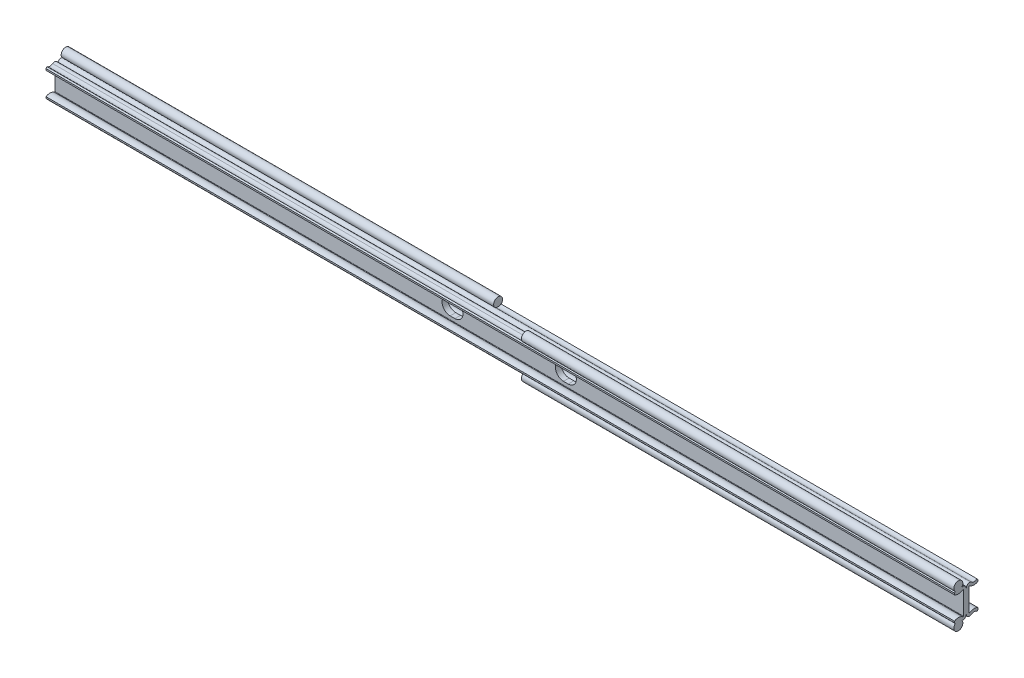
ISO-10303-21;
HEADER;
FILE_DESCRIPTION(('STEP AP214'),'2;1');
FILE_NAME('part.step','',(''),(''),'','','');
FILE_SCHEMA(('AUTOMOTIVE_DESIGN { 1 0 10303 214 1 1 1 1 }'));
ENDSEC;
DATA;
#1=APPLICATION_CONTEXT('core data for automotive mechanical design processes');
#2=APPLICATION_PROTOCOL_DEFINITION('international standard','automotive_design',2000,#1);
#3=PRODUCT_CONTEXT('',#1,'mechanical');
#4=PRODUCT('Part','Part','',(#3));
#5=PRODUCT_RELATED_PRODUCT_CATEGORY('part','',(#4));
#6=PRODUCT_DEFINITION_FORMATION('','',#4);
#7=PRODUCT_DEFINITION_CONTEXT('part definition',#1,'design');
#8=PRODUCT_DEFINITION('design','',#6,#7);
#9=PRODUCT_DEFINITION_SHAPE('','',#8);
#10=(LENGTH_UNIT() NAMED_UNIT(*) SI_UNIT(.MILLI.,.METRE.));
#11=(NAMED_UNIT(*) PLANE_ANGLE_UNIT() SI_UNIT($,.RADIAN.));
#12=(NAMED_UNIT(*) SI_UNIT($,.STERADIAN.) SOLID_ANGLE_UNIT());
#13=UNCERTAINTY_MEASURE_WITH_UNIT(LENGTH_MEASURE(1.E-05),#10,'distance_accuracy_value','');
#14=(GEOMETRIC_REPRESENTATION_CONTEXT(3) GLOBAL_UNCERTAINTY_ASSIGNED_CONTEXT((#13)) GLOBAL_UNIT_ASSIGNED_CONTEXT((#10,
#11,#12)) REPRESENTATION_CONTEXT('',''));
#15=CARTESIAN_POINT('',(0.,0.,0.));
#16=DIRECTION('',(0.,0.,1.));
#17=DIRECTION('',(1.,0.,0.));
#18=AXIS2_PLACEMENT_3D('',#15,#16,#17);
#19=CARTESIAN_POINT('',(-250.,9.67000022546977,4.31000011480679));
#20=DIRECTION('',(1.,0.,0.));
#21=DIRECTION('',(0.,0.,-1.));
#22=AXIS2_PLACEMENT_3D('',#19,#20,#21);
#23=CYLINDRICAL_SURFACE('',#22,2.48000011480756);
#24=CARTESIAN_POINT('',(12.,9.67000022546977,4.31000011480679));
#25=DIRECTION('',(1.,0.,0.));
#26=DIRECTION('',(0.,0.,-1.));
#27=AXIS2_PLACEMENT_3D('',#24,#25,#26);
#28=CIRCLE('',#27,2.48000011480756);
#29=CARTESIAN_POINT('',(12.,7.69573962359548,2.80910183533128));
#30=VERTEX_POINT('',#29);
#31=CARTESIAN_POINT('',(12.,7.77020990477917,5.90411344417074));
#32=VERTEX_POINT('',#31);
#33=EDGE_CURVE('E323',#30,#32,#28,.F.);
#34=ORIENTED_EDGE('',*,*,#33,.F.);
#35=DIRECTION('',(1.,0.,0.));
#36=VECTOR('',#35,1.);
#37=CARTESIAN_POINT('',(-250.,7.69573962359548,2.80910183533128));
#38=LINE('',#37,#36);
#39=CARTESIAN_POINT('',(-250.,7.69573962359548,2.80910183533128));
#40=VERTEX_POINT('',#39);
#41=EDGE_CURVE('E545',#40,#30,#38,.T.);
#42=ORIENTED_EDGE('',*,*,#41,.F.);
#43=CARTESIAN_POINT('',(-250.,9.67000022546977,4.31000011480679));
#44=DIRECTION('',(1.,0.,0.));
#45=DIRECTION('',(0.,0.,-1.));
#46=AXIS2_PLACEMENT_3D('',#43,#44,#45);
#47=CIRCLE('',#46,2.48000011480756);
#48=CARTESIAN_POINT('',(-250.,7.77020990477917,5.90411344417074));
#49=VERTEX_POINT('',#48);
#50=EDGE_CURVE('E506',#49,#40,#47,.T.);
#51=ORIENTED_EDGE('',*,*,#50,.F.);
#52=DIRECTION('',(1.,0.,0.));
#53=VECTOR('',#52,1.);
#54=CARTESIAN_POINT('',(-250.,7.77020990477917,5.90411344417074));
#55=LINE('',#54,#53);
#56=EDGE_CURVE('E548',#49,#32,#55,.T.);
#57=ORIENTED_EDGE('',*,*,#56,.T.);
#58=EDGE_LOOP('',(#34,#42,#51,#57));
#59=FACE_BOUND('',#58,.T.);
#60=ADVANCED_FACE('F14',(#59),#23,.F.);
#61=CARTESIAN_POINT('',(-250.,9.67000022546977,-4.31000011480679));
#62=DIRECTION('',(1.,0.,0.));
#63=DIRECTION('',(0.,0.,-1.));
#64=AXIS2_PLACEMENT_3D('',#61,#62,#63);
#65=CYLINDRICAL_SURFACE('',#64,2.48000011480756);
#66=CARTESIAN_POINT('',(-12.,9.67000022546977,-4.31000011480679));
#67=DIRECTION('',(-1.,0.,0.));
#68=DIRECTION('',(0.,0.,1.));
#69=AXIS2_PLACEMENT_3D('',#66,#67,#68);
#70=CIRCLE('',#69,2.48000011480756);
#71=CARTESIAN_POINT('',(-12.,7.69573962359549,-2.80910183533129));
#72=VERTEX_POINT('',#71);
#73=CARTESIAN_POINT('',(-12.,7.77020990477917,-5.90411344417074));
#74=VERTEX_POINT('',#73);
#75=EDGE_CURVE('E357',#72,#74,#70,.F.);
#76=ORIENTED_EDGE('',*,*,#75,.F.);
#77=DIRECTION('',(1.,0.,0.));
#78=VECTOR('',#77,1.);
#79=CARTESIAN_POINT('',(-250.,7.69573962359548,-2.80910183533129));
#80=LINE('',#79,#78);
#81=CARTESIAN_POINT('',(250.,7.69573962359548,-2.80910183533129));
#82=VERTEX_POINT('',#81);
#83=EDGE_CURVE('E540',#72,#82,#80,.T.);
#84=ORIENTED_EDGE('',*,*,#83,.T.);
#85=CARTESIAN_POINT('',(250.,9.67000022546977,-4.31000011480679));
#86=DIRECTION('',(1.,0.,0.));
#87=DIRECTION('',(0.,0.,1.));
#88=AXIS2_PLACEMENT_3D('',#85,#86,#87);
#89=CIRCLE('',#88,2.48000011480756);
#90=CARTESIAN_POINT('',(250.,7.77020990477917,-5.90411344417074));
#91=VERTEX_POINT('',#90);
#92=EDGE_CURVE('E459',#82,#91,#89,.T.);
#93=ORIENTED_EDGE('',*,*,#92,.T.);
#94=DIRECTION('',(1.,0.,0.));
#95=VECTOR('',#94,1.);
#96=CARTESIAN_POINT('',(-250.,7.77020990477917,-5.90411344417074));
#97=LINE('',#96,#95);
#98=EDGE_CURVE('E538',#74,#91,#97,.T.);
#99=ORIENTED_EDGE('',*,*,#98,.F.);
#100=EDGE_LOOP('',(#76,#84,#93,#99));
#101=FACE_BOUND('',#100,.T.);
#102=ADVANCED_FACE('F682',(#101),#65,.F.);
#103=CARTESIAN_POINT('',(-250.,-6.30261222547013,-1.75000011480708));
#104=DIRECTION('',(1.,0.,0.));
#105=DIRECTION('',(0.,0.,-1.));
#106=AXIS2_PLACEMENT_3D('',#103,#104,#105);
#107=CYLINDRICAL_SURFACE('',#106,0.200000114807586);
#108=CARTESIAN_POINT('',(250.,-6.30261222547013,-1.75000011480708));
#109=DIRECTION('',(1.,0.,0.));
#110=DIRECTION('',(0.,0.,-1.));
#111=AXIS2_PLACEMENT_3D('',#108,#109,#110);
#112=CIRCLE('',#111,0.200000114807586);
#113=CARTESIAN_POINT('',(250.,-6.30261222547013,-1.54999999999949));
#114=VERTEX_POINT('',#113);
#115=CARTESIAN_POINT('',(250.,-6.46182696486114,-1.87104024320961));
#116=VERTEX_POINT('',#115);
#117=EDGE_CURVE('E423',#114,#116,#112,.T.);
#118=ORIENTED_EDGE('',*,*,#117,.T.);
#119=DIRECTION('',(1.,0.,0.));
#120=VECTOR('',#119,1.);
#121=CARTESIAN_POINT('',(-250.,-6.46182696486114,-1.87104024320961));
#122=LINE('',#121,#120);
#123=CARTESIAN_POINT('',(-250.,-6.46182696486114,-1.87104024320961));
#124=VERTEX_POINT('',#123);
#125=EDGE_CURVE('E591',#124,#116,#122,.T.);
#126=ORIENTED_EDGE('',*,*,#125,.F.);
#127=CARTESIAN_POINT('',(-250.,-6.30261222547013,-1.75000011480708));
#128=DIRECTION('',(1.,0.,0.));
#129=DIRECTION('',(0.,0.,-1.));
#130=AXIS2_PLACEMENT_3D('',#127,#128,#129);
#131=CIRCLE('',#130,0.200000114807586);
#132=CARTESIAN_POINT('',(-250.,-6.30261222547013,-1.54999999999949));
#133=VERTEX_POINT('',#132);
#134=EDGE_CURVE('E472',#133,#124,#131,.T.);
#135=ORIENTED_EDGE('',*,*,#134,.F.);
#136=DIRECTION('',(1.,0.,0.));
#137=VECTOR('',#136,1.);
#138=CARTESIAN_POINT('',(-250.,-6.30261222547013,-1.54999999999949));
#139=LINE('',#138,#137);
#140=EDGE_CURVE('E523',#133,#114,#139,.T.);
#141=ORIENTED_EDGE('',*,*,#140,.T.);
#142=EDGE_LOOP('',(#118,#126,#135,#141));
#143=FACE_BOUND('',#142,.T.);
#144=ADVANCED_FACE('F16',(#143),#107,.F.);
#145=CARTESIAN_POINT('',(-250.,-9.67000022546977,-4.31000011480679));
#146=DIRECTION('',(1.,0.,0.));
#147=DIRECTION('',(0.,0.,-1.));
#148=AXIS2_PLACEMENT_3D('',#145,#146,#147);
#149=CYLINDRICAL_SURFACE('',#148,4.03000011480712);
#150=CARTESIAN_POINT('',(250.,-9.67000022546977,-4.31000011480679));
#151=DIRECTION('',(-1.,0.,0.));
#152=DIRECTION('',(0.,0.,-1.));
#153=AXIS2_PLACEMENT_3D('',#150,#151,#152);
#154=CIRCLE('',#153,4.03000011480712);
#155=CARTESIAN_POINT('',(250.,-6.26775086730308,-6.47000016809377));
#156=VERTEX_POINT('',#155);
#157=EDGE_CURVE('E426',#116,#156,#154,.T.);
#158=ORIENTED_EDGE('',*,*,#157,.T.);
#159=DIRECTION('',(1.,0.,0.));
#160=VECTOR('',#159,1.);
#161=CARTESIAN_POINT('',(-250.,-6.26775086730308,-6.47000016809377));
#162=LINE('',#161,#160);
#163=CARTESIAN_POINT('',(-250.,-6.26775086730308,-6.47000016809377));
#164=VERTEX_POINT('',#163);
#165=EDGE_CURVE('E588',#164,#156,#162,.T.);
#166=ORIENTED_EDGE('',*,*,#165,.F.);
#167=CARTESIAN_POINT('',(-250.,-9.67000022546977,-4.31000011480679));
#168=DIRECTION('',(-1.,0.,0.));
#169=DIRECTION('',(0.,0.,-1.));
#170=AXIS2_PLACEMENT_3D('',#167,#168,#169);
#171=CIRCLE('',#170,4.03000011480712);
#172=EDGE_CURVE('E475',#124,#164,#171,.T.);
#173=ORIENTED_EDGE('',*,*,#172,.F.);
#174=ORIENTED_EDGE('',*,*,#125,.T.);
#175=EDGE_LOOP('',(#158,#166,#173,#174));
#176=FACE_BOUND('',#175,.T.);
#177=ADVANCED_FACE('F731',(#176),#149,.T.);
#178=CARTESIAN_POINT('',(-250.,-6.26775086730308,-6.47000016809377));
#179=DIRECTION('',(0.,0.,1.));
#180=DIRECTION('',(1.,0.,0.));
#181=AXIS2_PLACEMENT_3D('',#178,#179,#180);
#182=PLANE('',#181);
#183=DIRECTION('',(0.,-1.,0.));
#184=VECTOR('',#183,1.);
#185=CARTESIAN_POINT('',(250.,-6.26775086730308,-6.47000016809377));
#186=LINE('',#185,#184);
#187=CARTESIAN_POINT('',(250.,-7.09581212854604,-6.47000016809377));
#188=VERTEX_POINT('',#187);
#189=EDGE_CURVE('E428',#156,#188,#186,.T.);
#190=ORIENTED_EDGE('',*,*,#189,.T.);
#191=DIRECTION('',(1.,0.,0.));
#192=VECTOR('',#191,1.);
#193=CARTESIAN_POINT('',(-250.,-7.09581212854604,-6.47000016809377));
#194=LINE('',#193,#192);
#195=CARTESIAN_POINT('',(-250.,-7.09581212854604,-6.47000016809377));
#196=VERTEX_POINT('',#195);
#197=EDGE_CURVE('E585',#196,#188,#194,.T.);
#198=ORIENTED_EDGE('',*,*,#197,.F.);
#199=DIRECTION('',(0.,-1.,0.));
#200=VECTOR('',#199,1.);
#201=CARTESIAN_POINT('',(-250.,-6.26775086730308,-6.47000016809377));
#202=LINE('',#201,#200);
#203=EDGE_CURVE('E477',#164,#196,#202,.T.);
#204=ORIENTED_EDGE('',*,*,#203,.F.);
#205=ORIENTED_EDGE('',*,*,#165,.T.);
#206=EDGE_LOOP('',(#190,#198,#204,#205));
#207=FACE_BOUND('',#206,.T.);
#208=ADVANCED_FACE('F728',(#207),#182,.F.);
#209=CARTESIAN_POINT('',(-250.,-7.77020990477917,-5.90411344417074));
#210=DIRECTION('',(0.,0.642787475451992,0.766044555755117));
#211=DIRECTION('',(0.,0.766044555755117,-0.642787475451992));
#212=AXIS2_PLACEMENT_3D('',#209,#210,#211);
#213=PLANE('',#212);
#214=DIRECTION('',(0.,0.766044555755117,-0.642787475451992));
#215=VECTOR('',#214,1.);
#216=CARTESIAN_POINT('',(-12.,-7.77020990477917,-5.90411344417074));
#217=LINE('',#216,#215);
#218=CARTESIAN_POINT('',(-12.,-7.77020990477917,-5.90411344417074));
#219=VERTEX_POINT('',#218);
#220=CARTESIAN_POINT('',(-12.,-7.62948341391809,-6.02219694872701));
#221=VERTEX_POINT('',#220);
#222=EDGE_CURVE('E343',#219,#221,#217,.T.);
#223=ORIENTED_EDGE('',*,*,#222,.T.);
#224=DIRECTION('',(-1.,0.,0.));
#225=VECTOR('',#224,1.);
#226=CARTESIAN_POINT('',(-12.,-7.62948341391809,-6.02219694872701));
#227=LINE('',#226,#225);
#228=CARTESIAN_POINT('',(-250.,-7.62948341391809,-6.02219694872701));
#229=VERTEX_POINT('',#228);
#230=EDGE_CURVE('E337',#221,#229,#227,.T.);
#231=ORIENTED_EDGE('',*,*,#230,.T.);
#232=DIRECTION('',(0.,-0.766044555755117,0.642787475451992));
#233=VECTOR('',#232,1.);
#234=CARTESIAN_POINT('',(-250.,-7.77020990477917,-5.90411344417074));
#235=LINE('',#234,#233);
#236=EDGE_CURVE('E479',#196,#229,#235,.T.);
#237=ORIENTED_EDGE('',*,*,#236,.F.);
#238=ORIENTED_EDGE('',*,*,#197,.T.);
#239=DIRECTION('',(0.,-0.766044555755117,0.642787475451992));
#240=VECTOR('',#239,1.);
#241=CARTESIAN_POINT('',(250.,-7.77020990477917,-5.90411344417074));
#242=LINE('',#241,#240);
#243=CARTESIAN_POINT('',(250.,-7.77020990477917,-5.90411344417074));
#244=VERTEX_POINT('',#243);
#245=EDGE_CURVE('E430',#188,#244,#242,.T.);
#246=ORIENTED_EDGE('',*,*,#245,.T.);
#247=DIRECTION('',(1.,0.,0.));
#248=VECTOR('',#247,1.);
#249=CARTESIAN_POINT('',(-250.,-7.77020990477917,-5.90411344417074));
#250=LINE('',#249,#248);
#251=EDGE_CURVE('E583',#219,#244,#250,.T.);
#252=ORIENTED_EDGE('',*,*,#251,.F.);
#253=EDGE_LOOP('',(#223,#231,#237,#238,#246,#252));
#254=FACE_BOUND('',#253,.T.);
#255=ADVANCED_FACE('F724',(#254),#213,.F.);
#256=CARTESIAN_POINT('',(-250.,-9.67000022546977,-4.31000011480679));
#257=DIRECTION('',(1.,0.,0.));
#258=DIRECTION('',(0.,0.,-1.));
#259=AXIS2_PLACEMENT_3D('',#256,#257,#258);
#260=CYLINDRICAL_SURFACE('',#259,2.48000011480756);
#261=DIRECTION('',(1.,0.,0.));
#262=VECTOR('',#261,1.);
#263=CARTESIAN_POINT('',(-250.,-7.69573962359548,-2.80910183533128));
#264=LINE('',#263,#262);
#265=CARTESIAN_POINT('',(-12.,-7.69573962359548,-2.80910183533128));
#266=VERTEX_POINT('',#265);
#267=CARTESIAN_POINT('',(250.,-7.69573962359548,-2.80910183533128));
#268=VERTEX_POINT('',#267);
#269=EDGE_CURVE('E581',#266,#268,#264,.T.);
#270=ORIENTED_EDGE('',*,*,#269,.F.);
#271=CARTESIAN_POINT('',(-12.,-9.67000022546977,-4.31000011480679));
#272=DIRECTION('',(1.,0.,0.));
#273=DIRECTION('',(0.,0.,-1.));
#274=AXIS2_PLACEMENT_3D('',#271,#272,#273);
#275=CIRCLE('',#274,2.48000011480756);
#276=EDGE_CURVE('E340',#266,#219,#275,.F.);
#277=ORIENTED_EDGE('',*,*,#276,.T.);
#278=ORIENTED_EDGE('',*,*,#251,.T.);
#279=CARTESIAN_POINT('',(250.,-9.67000022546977,-4.31000011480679));
#280=DIRECTION('',(1.,0.,0.));
#281=DIRECTION('',(0.,0.,-1.));
#282=AXIS2_PLACEMENT_3D('',#279,#280,#281);
#283=CIRCLE('',#282,2.48000011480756);
#284=EDGE_CURVE('E433',#244,#268,#283,.T.);
#285=ORIENTED_EDGE('',*,*,#284,.T.);
#286=EDGE_LOOP('',(#270,#277,#278,#285));
#287=FACE_BOUND('',#286,.T.);
#288=ADVANCED_FACE('F720',(#287),#260,.F.);
#289=CARTESIAN_POINT('',(-250.,-6.30261222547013,-1.75000011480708));
#290=DIRECTION('',(1.,0.,0.));
#291=DIRECTION('',(0.,0.,-1.));
#292=AXIS2_PLACEMENT_3D('',#289,#290,#291);
#293=CYLINDRICAL_SURFACE('',#292,1.75000011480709);
#294=CARTESIAN_POINT('',(-250.,-6.30261222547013,-1.75000011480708));
#295=DIRECTION('',(-1.,0.,0.));
#296=DIRECTION('',(0.,0.,-1.));
#297=AXIS2_PLACEMENT_3D('',#294,#295,#296);
#298=CIRCLE('',#297,1.75000011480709);
#299=CARTESIAN_POINT('',(-250.,-7.91637379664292,-2.42695948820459));
#300=VERTEX_POINT('',#299);
#301=CARTESIAN_POINT('',(-250.,-6.30261222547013,0.));
#302=VERTEX_POINT('',#301);
#303=EDGE_CURVE('E482',#300,#302,#298,.T.);
#304=ORIENTED_EDGE('',*,*,#303,.F.);
#305=DIRECTION('',(-1.,0.,0.));
#306=VECTOR('',#305,1.);
#307=CARTESIAN_POINT('',(-131.,-7.91637379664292,-2.42695948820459));
#308=LINE('',#307,#306);
#309=CARTESIAN_POINT('',(-12.,-7.91637379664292,-2.42695948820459));
#310=VERTEX_POINT('',#309);
#311=EDGE_CURVE('E333',#300,#310,#308,.F.);
#312=ORIENTED_EDGE('',*,*,#311,.T.);
#313=CARTESIAN_POINT('',(-12.,-6.30261222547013,-1.75000011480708));
#314=DIRECTION('',(1.,0.,0.));
#315=DIRECTION('',(0.,0.,-1.));
#316=AXIS2_PLACEMENT_3D('',#313,#314,#315);
#317=CIRCLE('',#316,1.75000011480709);
#318=EDGE_CURVE('E596',#310,#266,#317,.T.);
#319=ORIENTED_EDGE('',*,*,#318,.T.);
#320=ORIENTED_EDGE('',*,*,#269,.T.);
#321=CARTESIAN_POINT('',(250.,-6.30261222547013,-1.75000011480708));
#322=DIRECTION('',(-1.,0.,0.));
#323=DIRECTION('',(0.,0.,-1.));
#324=AXIS2_PLACEMENT_3D('',#321,#322,#323);
#325=CIRCLE('',#324,1.75000011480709);
#326=CARTESIAN_POINT('',(250.,-6.30261222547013,0.));
#327=VERTEX_POINT('',#326);
#328=EDGE_CURVE('E436',#268,#327,#325,.T.);
#329=ORIENTED_EDGE('',*,*,#328,.T.);
#330=DIRECTION('',(1.,0.,0.));
#331=VECTOR('',#330,1.);
#332=CARTESIAN_POINT('',(-250.,-6.30261222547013,0.));
#333=LINE('',#332,#331);
#334=EDGE_CURVE('E578',#302,#327,#333,.T.);
#335=ORIENTED_EDGE('',*,*,#334,.F.);
#336=EDGE_LOOP('',(#304,#312,#319,#320,#329,#335));
#337=FACE_BOUND('',#336,.T.);
#338=ADVANCED_FACE('F717',(#337),#293,.T.);
#339=CARTESIAN_POINT('',(-250.,-6.30261222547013,1.75000011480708));
#340=DIRECTION('',(1.,0.,0.));
#341=DIRECTION('',(0.,0.,-1.));
#342=AXIS2_PLACEMENT_3D('',#339,#340,#341);
#343=CYLINDRICAL_SURFACE('',#342,1.75000011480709);
#344=CARTESIAN_POINT('',(250.,-6.30261222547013,1.75000011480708));
#345=DIRECTION('',(-1.,0.,0.));
#346=DIRECTION('',(0.,0.,1.));
#347=AXIS2_PLACEMENT_3D('',#344,#345,#346);
#348=CIRCLE('',#347,1.75000011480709);
#349=CARTESIAN_POINT('',(250.,-7.91637379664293,2.42695948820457));
#350=VERTEX_POINT('',#349);
#351=EDGE_CURVE('E292',#327,#350,#348,.T.);
#352=ORIENTED_EDGE('',*,*,#351,.T.);
#353=DIRECTION('',(1.,0.,0.));
#354=VECTOR('',#353,1.);
#355=CARTESIAN_POINT('',(131.,-7.91637379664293,2.42695948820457));
#356=LINE('',#355,#354);
#357=CARTESIAN_POINT('',(12.,-7.91637379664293,2.42695948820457));
#358=VERTEX_POINT('',#357);
#359=EDGE_CURVE('E29',#350,#358,#356,.F.);
#360=ORIENTED_EDGE('',*,*,#359,.T.);
#361=CARTESIAN_POINT('',(12.,-6.30261222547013,1.75000011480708));
#362=DIRECTION('',(-1.,0.,0.));
#363=DIRECTION('',(0.,0.,1.));
#364=AXIS2_PLACEMENT_3D('',#361,#362,#363);
#365=CIRCLE('',#364,1.75000011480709);
#366=CARTESIAN_POINT('',(12.,-7.69573962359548,2.80910183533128));
#367=VERTEX_POINT('',#366);
#368=EDGE_CURVE('E33',#358,#367,#365,.T.);
#369=ORIENTED_EDGE('',*,*,#368,.T.);
#370=DIRECTION('',(1.,0.,0.));
#371=VECTOR('',#370,1.);
#372=CARTESIAN_POINT('',(-250.,-7.69573962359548,2.80910183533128));
#373=LINE('',#372,#371);
#374=CARTESIAN_POINT('',(-250.,-7.69573962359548,2.80910183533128));
#375=VERTEX_POINT('',#374);
#376=EDGE_CURVE('E576',#375,#367,#373,.T.);
#377=ORIENTED_EDGE('',*,*,#376,.F.);
#378=CARTESIAN_POINT('',(-250.,-6.30261222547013,1.75000011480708));
#379=DIRECTION('',(-1.,0.,0.));
#380=DIRECTION('',(0.,0.,1.));
#381=AXIS2_PLACEMENT_3D('',#378,#379,#380);
#382=CIRCLE('',#381,1.75000011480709);
#383=EDGE_CURVE('E484',#302,#375,#382,.T.);
#384=ORIENTED_EDGE('',*,*,#383,.F.);
#385=ORIENTED_EDGE('',*,*,#334,.T.);
#386=EDGE_LOOP('',(#352,#360,#369,#377,#384,#385));
#387=FACE_BOUND('',#386,.T.);
#388=ADVANCED_FACE('F714',(#387),#343,.T.);
#389=CARTESIAN_POINT('',(-250.,-9.67000022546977,4.31000011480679));
#390=DIRECTION('',(1.,0.,0.));
#391=DIRECTION('',(0.,0.,-1.));
#392=AXIS2_PLACEMENT_3D('',#389,#390,#391);
#393=CYLINDRICAL_SURFACE('',#392,2.48000011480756);
#394=ORIENTED_EDGE('',*,*,#376,.T.);
#395=CARTESIAN_POINT('',(12.,-9.67000022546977,4.31000011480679));
#396=DIRECTION('',(-1.,0.,0.));
#397=DIRECTION('',(0.,0.,1.));
#398=AXIS2_PLACEMENT_3D('',#395,#396,#397);
#399=CIRCLE('',#398,2.48000011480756);
#400=CARTESIAN_POINT('',(12.,-7.77020990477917,5.90411344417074));
#401=VERTEX_POINT('',#400);
#402=EDGE_CURVE('E309',#367,#401,#399,.F.);
#403=ORIENTED_EDGE('',*,*,#402,.T.);
#404=DIRECTION('',(1.,0.,0.));
#405=VECTOR('',#404,1.);
#406=CARTESIAN_POINT('',(-250.,-7.77020990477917,5.90411344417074));
#407=LINE('',#406,#405);
#408=CARTESIAN_POINT('',(-250.,-7.77020990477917,5.90411344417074));
#409=VERTEX_POINT('',#408);
#410=EDGE_CURVE('E574',#409,#401,#407,.T.);
#411=ORIENTED_EDGE('',*,*,#410,.F.);
#412=CARTESIAN_POINT('',(-250.,-9.67000022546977,4.31000011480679));
#413=DIRECTION('',(1.,0.,0.));
#414=DIRECTION('',(0.,0.,1.));
#415=AXIS2_PLACEMENT_3D('',#412,#413,#414);
#416=CIRCLE('',#415,2.48000011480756);
#417=EDGE_CURVE('E486',#375,#409,#416,.T.);
#418=ORIENTED_EDGE('',*,*,#417,.F.);
#419=EDGE_LOOP('',(#394,#403,#411,#418));
#420=FACE_BOUND('',#419,.T.);
#421=ADVANCED_FACE('F667',(#420),#393,.F.);
#422=CARTESIAN_POINT('',(-250.,-7.77020990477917,5.90411344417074));
#423=DIRECTION('',(0.,0.642787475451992,-0.766044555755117));
#424=DIRECTION('',(0.,-0.766044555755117,-0.642787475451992));
#425=AXIS2_PLACEMENT_3D('',#422,#423,#424);
#426=PLANE('',#425);
#427=DIRECTION('',(0.,0.766044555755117,0.642787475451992));
#428=VECTOR('',#427,1.);
#429=CARTESIAN_POINT('',(12.,-7.77020990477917,5.90411344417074));
#430=LINE('',#429,#428);
#431=CARTESIAN_POINT('',(12.,-7.62948341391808,6.02219694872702));
#432=VERTEX_POINT('',#431);
#433=EDGE_CURVE('E9',#401,#432,#430,.T.);
#434=ORIENTED_EDGE('',*,*,#433,.T.);
#435=DIRECTION('',(1.,0.,0.));
#436=VECTOR('',#435,1.);
#437=CARTESIAN_POINT('',(12.,-7.62948341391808,6.02219694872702));
#438=LINE('',#437,#436);
#439=CARTESIAN_POINT('',(250.,-7.62948341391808,6.02219694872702));
#440=VERTEX_POINT('',#439);
#441=EDGE_CURVE('E295',#432,#440,#438,.T.);
#442=ORIENTED_EDGE('',*,*,#441,.T.);
#443=DIRECTION('',(0.,0.766044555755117,0.642787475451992));
#444=VECTOR('',#443,1.);
#445=CARTESIAN_POINT('',(250.,-7.77020990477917,5.90411344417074));
#446=LINE('',#445,#444);
#447=CARTESIAN_POINT('',(250.,-7.09581212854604,6.47000016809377));
#448=VERTEX_POINT('',#447);
#449=EDGE_CURVE('E281',#440,#448,#446,.T.);
#450=ORIENTED_EDGE('',*,*,#449,.T.);
#451=DIRECTION('',(1.,0.,0.));
#452=VECTOR('',#451,1.);
#453=CARTESIAN_POINT('',(-250.,-7.09581212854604,6.47000016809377));
#454=LINE('',#453,#452);
#455=CARTESIAN_POINT('',(-250.,-7.09581212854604,6.47000016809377));
#456=VERTEX_POINT('',#455);
#457=EDGE_CURVE('E572',#456,#448,#454,.T.);
#458=ORIENTED_EDGE('',*,*,#457,.F.);
#459=DIRECTION('',(0.,0.766044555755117,0.642787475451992));
#460=VECTOR('',#459,1.);
#461=CARTESIAN_POINT('',(-250.,-7.77020990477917,5.90411344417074));
#462=LINE('',#461,#460);
#463=EDGE_CURVE('E488',#409,#456,#462,.T.);
#464=ORIENTED_EDGE('',*,*,#463,.F.);
#465=ORIENTED_EDGE('',*,*,#410,.T.);
#466=EDGE_LOOP('',(#434,#442,#450,#458,#464,#465));
#467=FACE_BOUND('',#466,.T.);
#468=ADVANCED_FACE('F296',(#467),#426,.F.);
#469=CARTESIAN_POINT('',(-250.,-6.26775086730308,6.47000016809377));
#470=DIRECTION('',(0.,0.,-1.));
#471=DIRECTION('',(-1.,0.,0.));
#472=AXIS2_PLACEMENT_3D('',#469,#470,#471);
#473=PLANE('',#472);
#474=DIRECTION('',(0.,1.,0.));
#475=VECTOR('',#474,1.);
#476=CARTESIAN_POINT('',(250.,-6.26775086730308,6.47000016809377));
#477=LINE('',#476,#475);
#478=CARTESIAN_POINT('',(250.,-6.26775086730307,6.47000016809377));
#479=VERTEX_POINT('',#478);
#480=EDGE_CURVE('E288',#448,#479,#477,.T.);
#481=ORIENTED_EDGE('',*,*,#480,.T.);
#482=DIRECTION('',(1.,0.,0.));
#483=VECTOR('',#482,1.);
#484=CARTESIAN_POINT('',(-250.,-6.26775086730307,6.47000016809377));
#485=LINE('',#484,#483);
#486=CARTESIAN_POINT('',(-250.,-6.26775086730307,6.47000016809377));
#487=VERTEX_POINT('',#486);
#488=EDGE_CURVE('E569',#487,#479,#485,.T.);
#489=ORIENTED_EDGE('',*,*,#488,.F.);
#490=DIRECTION('',(0.,1.,0.));
#491=VECTOR('',#490,1.);
#492=CARTESIAN_POINT('',(-250.,-6.26775086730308,6.47000016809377));
#493=LINE('',#492,#491);
#494=EDGE_CURVE('E490',#456,#487,#493,.T.);
#495=ORIENTED_EDGE('',*,*,#494,.F.);
#496=ORIENTED_EDGE('',*,*,#457,.T.);
#497=EDGE_LOOP('',(#481,#489,#495,#496));
#498=FACE_BOUND('',#497,.T.);
#499=ADVANCED_FACE('F661',(#498),#473,.F.);
#500=CARTESIAN_POINT('',(-250.,-9.67000022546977,4.31000011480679));
#501=DIRECTION('',(1.,0.,0.));
#502=DIRECTION('',(0.,0.,-1.));
#503=AXIS2_PLACEMENT_3D('',#500,#501,#502);
#504=CYLINDRICAL_SURFACE('',#503,4.03000011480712);
#505=CARTESIAN_POINT('',(250.,-9.67000022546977,4.31000011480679));
#506=DIRECTION('',(-1.,0.,0.));
#507=DIRECTION('',(0.,0.,1.));
#508=AXIS2_PLACEMENT_3D('',#505,#506,#507);
#509=CIRCLE('',#508,4.03000011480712);
#510=CARTESIAN_POINT('',(250.,-6.46182696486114,1.87104024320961));
#511=VERTEX_POINT('',#510);
#512=EDGE_CURVE('E440',#479,#511,#509,.T.);
#513=ORIENTED_EDGE('',*,*,#512,.T.);
#514=DIRECTION('',(1.,0.,0.));
#515=VECTOR('',#514,1.);
#516=CARTESIAN_POINT('',(-250.,-6.46182696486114,1.87104024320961));
#517=LINE('',#516,#515);
#518=CARTESIAN_POINT('',(-250.,-6.46182696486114,1.87104024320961));
#519=VERTEX_POINT('',#518);
#520=EDGE_CURVE('E566',#519,#511,#517,.T.);
#521=ORIENTED_EDGE('',*,*,#520,.F.);
#522=CARTESIAN_POINT('',(-250.,-9.67000022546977,4.31000011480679));
#523=DIRECTION('',(-1.,0.,0.));
#524=DIRECTION('',(0.,0.,1.));
#525=AXIS2_PLACEMENT_3D('',#522,#523,#524);
#526=CIRCLE('',#525,4.03000011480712);
#527=EDGE_CURVE('E492',#487,#519,#526,.T.);
#528=ORIENTED_EDGE('',*,*,#527,.F.);
#529=ORIENTED_EDGE('',*,*,#488,.T.);
#530=EDGE_LOOP('',(#513,#521,#528,#529));
#531=FACE_BOUND('',#530,.T.);
#532=ADVANCED_FACE('F657',(#531),#504,.T.);
#533=CARTESIAN_POINT('',(-250.,-6.30261222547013,1.75000011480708));
#534=DIRECTION('',(1.,0.,0.));
#535=DIRECTION('',(0.,0.,-1.));
#536=AXIS2_PLACEMENT_3D('',#533,#534,#535);
#537=CYLINDRICAL_SURFACE('',#536,0.200000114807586);
#538=CARTESIAN_POINT('',(250.,-6.30261222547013,1.75000011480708));
#539=DIRECTION('',(1.,0.,0.));
#540=DIRECTION('',(0.,0.,1.));
#541=AXIS2_PLACEMENT_3D('',#538,#539,#540);
#542=CIRCLE('',#541,0.200000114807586);
#543=CARTESIAN_POINT('',(250.,-6.30261222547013,1.54999999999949));
#544=VERTEX_POINT('',#543);
#545=EDGE_CURVE('E442',#511,#544,#542,.T.);
#546=ORIENTED_EDGE('',*,*,#545,.T.);
#547=DIRECTION('',(1.,0.,0.));
#548=VECTOR('',#547,1.);
#549=CARTESIAN_POINT('',(-250.,-6.30261222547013,1.54999999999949));
#550=LINE('',#549,#548);
#551=CARTESIAN_POINT('',(-250.,-6.30261222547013,1.54999999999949));
#552=VERTEX_POINT('',#551);
#553=EDGE_CURVE('E563',#552,#544,#550,.T.);
#554=ORIENTED_EDGE('',*,*,#553,.F.);
#555=CARTESIAN_POINT('',(-250.,-6.30261222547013,1.75000011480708));
#556=DIRECTION('',(1.,0.,0.));
#557=DIRECTION('',(0.,0.,1.));
#558=AXIS2_PLACEMENT_3D('',#555,#556,#557);
#559=CIRCLE('',#558,0.200000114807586);
#560=EDGE_CURVE('E494',#519,#552,#559,.T.);
#561=ORIENTED_EDGE('',*,*,#560,.F.);
#562=ORIENTED_EDGE('',*,*,#520,.T.);
#563=EDGE_LOOP('',(#546,#554,#561,#562));
#564=FACE_BOUND('',#563,.T.);
#565=ADVANCED_FACE('F652',(#564),#537,.F.);
#566=CARTESIAN_POINT('',(-250.,-6.30261222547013,1.54999999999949));
#567=DIRECTION('',(0.,0.,-1.));
#568=DIRECTION('',(-1.,0.,0.));
#569=AXIS2_PLACEMENT_3D('',#566,#567,#568);
#570=PLANE('',#569);
#571=DIRECTION('',(1.,0.,0.));
#572=VECTOR('',#571,1.);
#573=CARTESIAN_POINT('',(-32.5,-4.45,1.54999999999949));
#574=LINE('',#573,#572);
#575=CARTESIAN_POINT('',(-32.5,-4.45,1.54999999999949));
#576=VERTEX_POINT('',#575);
#577=CARTESIAN_POINT('',(-29.9,-4.45,1.54999999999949));
#578=VERTEX_POINT('',#577);
#579=EDGE_CURVE('E371',#576,#578,#574,.T.);
#580=ORIENTED_EDGE('',*,*,#579,.F.);
#581=CARTESIAN_POINT('',(-32.5,0.,1.54999999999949));
#582=DIRECTION('',(0.,0.,1.));
#583=DIRECTION('',(-1.,0.,0.));
#584=AXIS2_PLACEMENT_3D('',#581,#582,#583);
#585=CIRCLE('',#584,4.45);
#586=CARTESIAN_POINT('',(-32.5,4.45,1.54999999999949));
#587=VERTEX_POINT('',#586);
#588=EDGE_CURVE('E369',#587,#576,#585,.T.);
#589=ORIENTED_EDGE('',*,*,#588,.F.);
#590=DIRECTION('',(-1.,0.,0.));
#591=VECTOR('',#590,1.);
#592=CARTESIAN_POINT('',(-29.9,4.45,1.54999999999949));
#593=LINE('',#592,#591);
#594=CARTESIAN_POINT('',(-29.9,4.45,1.54999999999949));
#595=VERTEX_POINT('',#594);
#596=EDGE_CURVE('E377',#595,#587,#593,.T.);
#597=ORIENTED_EDGE('',*,*,#596,.F.);
#598=CARTESIAN_POINT('',(-29.9,0.,1.54999999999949));
#599=DIRECTION('',(0.,0.,1.));
#600=DIRECTION('',(-1.,0.,0.));
#601=AXIS2_PLACEMENT_3D('',#598,#599,#600);
#602=CIRCLE('',#601,4.45);
#603=EDGE_CURVE('E374',#578,#595,#602,.T.);
#604=ORIENTED_EDGE('',*,*,#603,.F.);
#605=EDGE_LOOP('',(#580,#589,#597,#604));
#606=FACE_BOUND('',#605,.T.);
#607=DIRECTION('',(1.,0.,0.));
#608=VECTOR('',#607,1.);
#609=CARTESIAN_POINT('',(32.5,-4.45,1.54999999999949));
#610=LINE('',#609,#608);
#611=CARTESIAN_POINT('',(29.9,-4.45,1.54999999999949));
#612=VERTEX_POINT('',#611);
#613=CARTESIAN_POINT('',(32.5,-4.45,1.54999999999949));
#614=VERTEX_POINT('',#613);
#615=EDGE_CURVE('E402',#612,#614,#610,.T.);
#616=ORIENTED_EDGE('',*,*,#615,.F.);
#617=CARTESIAN_POINT('',(29.9,0.,1.54999999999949));
#618=DIRECTION('',(0.,0.,1.));
#619=DIRECTION('',(1.,0.,0.));
#620=AXIS2_PLACEMENT_3D('',#617,#618,#619);
#621=CIRCLE('',#620,4.45);
#622=CARTESIAN_POINT('',(29.9,4.45,1.54999999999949));
#623=VERTEX_POINT('',#622);
#624=EDGE_CURVE('E400',#623,#612,#621,.T.);
#625=ORIENTED_EDGE('',*,*,#624,.F.);
#626=DIRECTION('',(-1.,0.,0.));
#627=VECTOR('',#626,1.);
#628=CARTESIAN_POINT('',(29.9,4.45,1.54999999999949));
#629=LINE('',#628,#627);
#630=CARTESIAN_POINT('',(32.5,4.45,1.54999999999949));
#631=VERTEX_POINT('',#630);
#632=EDGE_CURVE('E408',#631,#623,#629,.T.);
#633=ORIENTED_EDGE('',*,*,#632,.F.);
#634=CARTESIAN_POINT('',(32.5,0.,1.54999999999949));
#635=DIRECTION('',(0.,0.,1.));
#636=DIRECTION('',(1.,0.,0.));
#637=AXIS2_PLACEMENT_3D('',#634,#635,#636);
#638=CIRCLE('',#637,4.45);
#639=EDGE_CURVE('E405',#614,#631,#638,.T.);
#640=ORIENTED_EDGE('',*,*,#639,.F.);
#641=EDGE_LOOP('',(#616,#625,#633,#640));
#642=FACE_BOUND('',#641,.T.);
#643=DIRECTION('',(0.,1.,0.));
#644=VECTOR('',#643,1.);
#645=CARTESIAN_POINT('',(250.,-6.30261222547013,1.54999999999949));
#646=LINE('',#645,#644);
#647=CARTESIAN_POINT('',(250.,6.30261222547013,1.54999999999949));
#648=VERTEX_POINT('',#647);
#649=EDGE_CURVE('E444',#544,#648,#646,.T.);
#650=ORIENTED_EDGE('',*,*,#649,.T.);
#651=DIRECTION('',(1.,0.,0.));
#652=VECTOR('',#651,1.);
#653=CARTESIAN_POINT('',(-250.,6.30261222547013,1.54999999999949));
#654=LINE('',#653,#652);
#655=CARTESIAN_POINT('',(-250.,6.30261222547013,1.54999999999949));
#656=VERTEX_POINT('',#655);
#657=EDGE_CURVE('E560',#656,#648,#654,.T.);
#658=ORIENTED_EDGE('',*,*,#657,.F.);
#659=DIRECTION('',(0.,1.,0.));
#660=VECTOR('',#659,1.);
#661=CARTESIAN_POINT('',(-250.,-6.30261222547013,1.54999999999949));
#662=LINE('',#661,#660);
#663=EDGE_CURVE('E496',#552,#656,#662,.T.);
#664=ORIENTED_EDGE('',*,*,#663,.F.);
#665=ORIENTED_EDGE('',*,*,#553,.T.);
#666=EDGE_LOOP('',(#650,#658,#664,#665));
#667=FACE_BOUND('',#666,.T.);
#668=ADVANCED_FACE('F648',(#606,#642,#667),#570,.F.);
#669=CARTESIAN_POINT('',(-250.,6.30261222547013,1.75000011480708));
#670=DIRECTION('',(1.,0.,0.));
#671=DIRECTION('',(0.,0.,-1.));
#672=AXIS2_PLACEMENT_3D('',#669,#670,#671);
#673=CYLINDRICAL_SURFACE('',#672,0.200000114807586);
#674=CARTESIAN_POINT('',(250.,6.30261222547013,1.75000011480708));
#675=DIRECTION('',(1.,0.,0.));
#676=DIRECTION('',(0.,0.,-1.));
#677=AXIS2_PLACEMENT_3D('',#674,#675,#676);
#678=CIRCLE('',#677,0.200000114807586);
#679=CARTESIAN_POINT('',(250.,6.46182696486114,1.87104024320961));
#680=VERTEX_POINT('',#679);
#681=EDGE_CURVE('E446',#648,#680,#678,.T.);
#682=ORIENTED_EDGE('',*,*,#681,.T.);
#683=DIRECTION('',(1.,0.,0.));
#684=VECTOR('',#683,1.);
#685=CARTESIAN_POINT('',(-250.,6.46182696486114,1.87104024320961));
#686=LINE('',#685,#684);
#687=CARTESIAN_POINT('',(-250.,6.46182696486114,1.87104024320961));
#688=VERTEX_POINT('',#687);
#689=EDGE_CURVE('E557',#688,#680,#686,.T.);
#690=ORIENTED_EDGE('',*,*,#689,.F.);
#691=CARTESIAN_POINT('',(-250.,6.30261222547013,1.75000011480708));
#692=DIRECTION('',(1.,0.,0.));
#693=DIRECTION('',(0.,0.,-1.));
#694=AXIS2_PLACEMENT_3D('',#691,#692,#693);
#695=CIRCLE('',#694,0.200000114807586);
#696=EDGE_CURVE('E498',#656,#688,#695,.T.);
#697=ORIENTED_EDGE('',*,*,#696,.F.);
#698=ORIENTED_EDGE('',*,*,#657,.T.);
#699=EDGE_LOOP('',(#682,#690,#697,#698));
#700=FACE_BOUND('',#699,.T.);
#701=ADVANCED_FACE('F644',(#700),#673,.F.);
#702=CARTESIAN_POINT('',(-250.,9.67000022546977,4.31000011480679));
#703=DIRECTION('',(1.,0.,0.));
#704=DIRECTION('',(0.,0.,-1.));
#705=AXIS2_PLACEMENT_3D('',#702,#703,#704);
#706=CYLINDRICAL_SURFACE('',#705,4.03000011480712);
#707=CARTESIAN_POINT('',(250.,9.67000022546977,4.31000011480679));
#708=DIRECTION('',(-1.,0.,0.));
#709=DIRECTION('',(0.,0.,-1.));
#710=AXIS2_PLACEMENT_3D('',#707,#708,#709);
#711=CIRCLE('',#710,4.03000011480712);
#712=CARTESIAN_POINT('',(250.,6.26775086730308,6.47000016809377));
#713=VERTEX_POINT('',#712);
#714=EDGE_CURVE('E448',#680,#713,#711,.T.);
#715=ORIENTED_EDGE('',*,*,#714,.T.);
#716=DIRECTION('',(1.,0.,0.));
#717=VECTOR('',#716,1.);
#718=CARTESIAN_POINT('',(-250.,6.26775086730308,6.47000016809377));
#719=LINE('',#718,#717);
#720=CARTESIAN_POINT('',(-250.,6.26775086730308,6.47000016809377));
#721=VERTEX_POINT('',#720);
#722=EDGE_CURVE('E554',#721,#713,#719,.T.);
#723=ORIENTED_EDGE('',*,*,#722,.F.);
#724=CARTESIAN_POINT('',(-250.,9.67000022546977,4.31000011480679));
#725=DIRECTION('',(-1.,0.,0.));
#726=DIRECTION('',(0.,0.,-1.));
#727=AXIS2_PLACEMENT_3D('',#724,#725,#726);
#728=CIRCLE('',#727,4.03000011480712);
#729=EDGE_CURVE('E500',#688,#721,#728,.T.);
#730=ORIENTED_EDGE('',*,*,#729,.F.);
#731=ORIENTED_EDGE('',*,*,#689,.T.);
#732=EDGE_LOOP('',(#715,#723,#730,#731));
#733=FACE_BOUND('',#732,.T.);
#734=ADVANCED_FACE('F639',(#733),#706,.T.);
#735=CARTESIAN_POINT('',(-250.,6.26775086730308,6.47000016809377));
#736=DIRECTION('',(0.,0.,-1.));
#737=DIRECTION('',(-1.,0.,0.));
#738=AXIS2_PLACEMENT_3D('',#735,#736,#737);
#739=PLANE('',#738);
#740=DIRECTION('',(0.,1.,0.));
#741=VECTOR('',#740,1.);
#742=CARTESIAN_POINT('',(250.,6.26775086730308,6.47000016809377));
#743=LINE('',#742,#741);
#744=CARTESIAN_POINT('',(250.,7.09581212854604,6.47000016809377));
#745=VERTEX_POINT('',#744);
#746=EDGE_CURVE('E450',#713,#745,#743,.T.);
#747=ORIENTED_EDGE('',*,*,#746,.T.);
#748=DIRECTION('',(1.,0.,0.));
#749=VECTOR('',#748,1.);
#750=CARTESIAN_POINT('',(-250.,7.09581212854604,6.47000016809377));
#751=LINE('',#750,#749);
#752=CARTESIAN_POINT('',(-250.,7.09581212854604,6.47000016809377));
#753=VERTEX_POINT('',#752);
#754=EDGE_CURVE('E551',#753,#745,#751,.T.);
#755=ORIENTED_EDGE('',*,*,#754,.F.);
#756=DIRECTION('',(0.,1.,0.));
#757=VECTOR('',#756,1.);
#758=CARTESIAN_POINT('',(-250.,6.26775086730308,6.47000016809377));
#759=LINE('',#758,#757);
#760=EDGE_CURVE('E502',#721,#753,#759,.T.);
#761=ORIENTED_EDGE('',*,*,#760,.F.);
#762=ORIENTED_EDGE('',*,*,#722,.T.);
#763=EDGE_LOOP('',(#747,#755,#761,#762));
#764=FACE_BOUND('',#763,.T.);
#765=ADVANCED_FACE('F633',(#764),#739,.F.);
#766=CARTESIAN_POINT('',(-250.,7.77020990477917,5.90411344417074));
#767=DIRECTION('',(0.,-0.642787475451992,-0.766044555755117));
#768=DIRECTION('',(0.,-0.766044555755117,0.642787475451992));
#769=AXIS2_PLACEMENT_3D('',#766,#767,#768);
#770=PLANE('',#769);
#771=DIRECTION('',(0.,0.766044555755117,-0.642787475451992));
#772=VECTOR('',#771,1.);
#773=CARTESIAN_POINT('',(250.,7.77020990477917,5.90411344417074));
#774=LINE('',#773,#772);
#775=CARTESIAN_POINT('',(250.,7.62948341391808,6.02219694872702));
#776=VERTEX_POINT('',#775);
#777=EDGE_CURVE('E452',#745,#776,#774,.T.);
#778=ORIENTED_EDGE('',*,*,#777,.T.);
#779=DIRECTION('',(1.,0.,0.));
#780=VECTOR('',#779,1.);
#781=CARTESIAN_POINT('',(12.,7.62948341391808,6.02219694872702));
#782=LINE('',#781,#780);
#783=CARTESIAN_POINT('',(12.,7.62948341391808,6.02219694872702));
#784=VERTEX_POINT('',#783);
#785=EDGE_CURVE('E321',#776,#784,#782,.F.);
#786=ORIENTED_EDGE('',*,*,#785,.T.);
#787=DIRECTION('',(0.,-0.766044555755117,0.642787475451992));
#788=VECTOR('',#787,1.);
#789=CARTESIAN_POINT('',(12.,7.77020990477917,5.90411344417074));
#790=LINE('',#789,#788);
#791=EDGE_CURVE('E326',#32,#784,#790,.T.);
#792=ORIENTED_EDGE('',*,*,#791,.F.);
#793=ORIENTED_EDGE('',*,*,#56,.F.);
#794=DIRECTION('',(0.,0.766044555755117,-0.642787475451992));
#795=VECTOR('',#794,1.);
#796=CARTESIAN_POINT('',(-250.,7.77020990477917,5.90411344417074));
#797=LINE('',#796,#795);
#798=EDGE_CURVE('E504',#753,#49,#797,.T.);
#799=ORIENTED_EDGE('',*,*,#798,.F.);
#800=ORIENTED_EDGE('',*,*,#754,.T.);
#801=EDGE_LOOP('',(#778,#786,#792,#793,#799,#800));
#802=FACE_BOUND('',#801,.T.);
#803=ADVANCED_FACE('F629',(#802),#770,.F.);
#804=CARTESIAN_POINT('',(-250.,6.30261222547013,1.75000011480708));
#805=DIRECTION('',(1.,0.,0.));
#806=DIRECTION('',(0.,0.,-1.));
#807=AXIS2_PLACEMENT_3D('',#804,#805,#806);
#808=CYLINDRICAL_SURFACE('',#807,1.75000011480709);
#809=CARTESIAN_POINT('',(12.,6.30261222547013,1.75000011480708));
#810=DIRECTION('',(1.,0.,0.));
#811=DIRECTION('',(0.,0.,-1.));
#812=AXIS2_PLACEMENT_3D('',#809,#810,#811);
#813=CIRCLE('',#812,1.75000011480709);
#814=CARTESIAN_POINT('',(12.,7.91637379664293,2.42695948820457));
#815=VERTEX_POINT('',#814);
#816=EDGE_CURVE('E22',#815,#30,#813,.T.);
#817=ORIENTED_EDGE('',*,*,#816,.F.);
#818=DIRECTION('',(1.,0.,0.));
#819=VECTOR('',#818,1.);
#820=CARTESIAN_POINT('',(131.,7.91637379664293,2.42695948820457));
#821=LINE('',#820,#819);
#822=CARTESIAN_POINT('',(250.,7.91637379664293,2.42695948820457));
#823=VERTEX_POINT('',#822);
#824=EDGE_CURVE('E316',#815,#823,#821,.T.);
#825=ORIENTED_EDGE('',*,*,#824,.T.);
#826=CARTESIAN_POINT('',(250.,6.30261222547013,1.75000011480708));
#827=DIRECTION('',(-1.,0.,0.));
#828=DIRECTION('',(0.,0.,-1.));
#829=AXIS2_PLACEMENT_3D('',#826,#827,#828);
#830=CIRCLE('',#829,1.75000011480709);
#831=CARTESIAN_POINT('',(250.,6.30261222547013,0.));
#832=VERTEX_POINT('',#831);
#833=EDGE_CURVE('E454',#823,#832,#830,.T.);
#834=ORIENTED_EDGE('',*,*,#833,.T.);
#835=DIRECTION('',(1.,0.,0.));
#836=VECTOR('',#835,1.);
#837=CARTESIAN_POINT('',(-250.,6.30261222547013,0.));
#838=LINE('',#837,#836);
#839=CARTESIAN_POINT('',(-250.,6.30261222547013,0.));
#840=VERTEX_POINT('',#839);
#841=EDGE_CURVE('E542',#840,#832,#838,.T.);
#842=ORIENTED_EDGE('',*,*,#841,.F.);
#843=CARTESIAN_POINT('',(-250.,6.30261222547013,1.75000011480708));
#844=DIRECTION('',(-1.,0.,0.));
#845=DIRECTION('',(0.,0.,-1.));
#846=AXIS2_PLACEMENT_3D('',#843,#844,#845);
#847=CIRCLE('',#846,1.75000011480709);
#848=EDGE_CURVE('E508',#40,#840,#847,.T.);
#849=ORIENTED_EDGE('',*,*,#848,.F.);
#850=ORIENTED_EDGE('',*,*,#41,.T.);
#851=EDGE_LOOP('',(#817,#825,#834,#842,#849,#850));
#852=FACE_BOUND('',#851,.T.);
#853=ADVANCED_FACE('F604',(#852),#808,.T.);
#854=CARTESIAN_POINT('',(-250.,6.30261222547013,-1.75000011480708));
#855=DIRECTION('',(1.,0.,0.));
#856=DIRECTION('',(0.,0.,-1.));
#857=AXIS2_PLACEMENT_3D('',#854,#855,#856);
#858=CYLINDRICAL_SURFACE('',#857,1.75000011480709);
#859=CARTESIAN_POINT('',(-12.,6.30261222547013,-1.75000011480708));
#860=DIRECTION('',(-1.,0.,0.));
#861=DIRECTION('',(0.,0.,1.));
#862=AXIS2_PLACEMENT_3D('',#859,#860,#861);
#863=CIRCLE('',#862,1.75000011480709);
#864=CARTESIAN_POINT('',(-12.,7.91637379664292,-2.42695948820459));
#865=VERTEX_POINT('',#864);
#866=EDGE_CURVE('E359',#865,#72,#863,.T.);
#867=ORIENTED_EDGE('',*,*,#866,.F.);
#868=DIRECTION('',(-1.,0.,0.));
#869=VECTOR('',#868,1.);
#870=CARTESIAN_POINT('',(-131.,7.91637379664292,-2.42695948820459));
#871=LINE('',#870,#869);
#872=CARTESIAN_POINT('',(-250.,7.91637379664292,-2.42695948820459));
#873=VERTEX_POINT('',#872);
#874=EDGE_CURVE('E354',#865,#873,#871,.T.);
#875=ORIENTED_EDGE('',*,*,#874,.T.);
#876=CARTESIAN_POINT('',(-250.,6.30261222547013,-1.75000011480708));
#877=DIRECTION('',(-1.,0.,0.));
#878=DIRECTION('',(0.,0.,1.));
#879=AXIS2_PLACEMENT_3D('',#876,#877,#878);
#880=CIRCLE('',#879,1.75000011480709);
#881=EDGE_CURVE('E510',#840,#873,#880,.T.);
#882=ORIENTED_EDGE('',*,*,#881,.F.);
#883=ORIENTED_EDGE('',*,*,#841,.T.);
#884=CARTESIAN_POINT('',(250.,6.30261222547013,-1.75000011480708));
#885=DIRECTION('',(-1.,0.,0.));
#886=DIRECTION('',(0.,0.,1.));
#887=AXIS2_PLACEMENT_3D('',#884,#885,#886);
#888=CIRCLE('',#887,1.75000011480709);
#889=EDGE_CURVE('E456',#832,#82,#888,.T.);
#890=ORIENTED_EDGE('',*,*,#889,.T.);
#891=ORIENTED_EDGE('',*,*,#83,.F.);
#892=EDGE_LOOP('',(#867,#875,#882,#883,#890,#891));
#893=FACE_BOUND('',#892,.T.);
#894=ADVANCED_FACE('F619',(#893),#858,.T.);
#895=CARTESIAN_POINT('',(-250.,7.77020990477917,-5.90411344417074));
#896=DIRECTION('',(0.,-0.642787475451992,0.766044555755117));
#897=DIRECTION('',(0.,0.766044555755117,0.642787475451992));
#898=AXIS2_PLACEMENT_3D('',#895,#896,#897);
#899=PLANE('',#898);
#900=DIRECTION('',(0.,-0.766044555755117,-0.642787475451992));
#901=VECTOR('',#900,1.);
#902=CARTESIAN_POINT('',(-250.,7.77020990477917,-5.90411344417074));
#903=LINE('',#902,#901);
#904=CARTESIAN_POINT('',(-250.,7.62948341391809,-6.02219694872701));
#905=VERTEX_POINT('',#904);
#906=CARTESIAN_POINT('',(-250.,7.09581212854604,-6.47000016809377));
#907=VERTEX_POINT('',#906);
#908=EDGE_CURVE('E513',#905,#907,#903,.T.);
#909=ORIENTED_EDGE('',*,*,#908,.F.);
#910=DIRECTION('',(-1.,0.,0.));
#911=VECTOR('',#910,1.);
#912=CARTESIAN_POINT('',(-12.,7.62948341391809,-6.02219694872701));
#913=LINE('',#912,#911);
#914=CARTESIAN_POINT('',(-12.,7.62948341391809,-6.02219694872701));
#915=VERTEX_POINT('',#914);
#916=EDGE_CURVE('E350',#905,#915,#913,.F.);
#917=ORIENTED_EDGE('',*,*,#916,.T.);
#918=DIRECTION('',(0.,-0.766044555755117,-0.642787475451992));
#919=VECTOR('',#918,1.);
#920=CARTESIAN_POINT('',(-12.,7.77020990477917,-5.90411344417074));
#921=LINE('',#920,#919);
#922=EDGE_CURVE('E594',#74,#915,#921,.T.);
#923=ORIENTED_EDGE('',*,*,#922,.F.);
#924=ORIENTED_EDGE('',*,*,#98,.T.);
#925=DIRECTION('',(0.,-0.766044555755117,-0.642787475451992));
#926=VECTOR('',#925,1.);
#927=CARTESIAN_POINT('',(250.,7.77020990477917,-5.90411344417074));
#928=LINE('',#927,#926);
#929=CARTESIAN_POINT('',(250.,7.09581212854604,-6.47000016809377));
#930=VERTEX_POINT('',#929);
#931=EDGE_CURVE('E462',#91,#930,#928,.T.);
#932=ORIENTED_EDGE('',*,*,#931,.T.);
#933=DIRECTION('',(1.,0.,0.));
#934=VECTOR('',#933,1.);
#935=CARTESIAN_POINT('',(-250.,7.09581212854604,-6.47000016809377));
#936=LINE('',#935,#934);
#937=EDGE_CURVE('E535',#907,#930,#936,.T.);
#938=ORIENTED_EDGE('',*,*,#937,.F.);
#939=EDGE_LOOP('',(#909,#917,#923,#924,#932,#938));
#940=FACE_BOUND('',#939,.T.);
#941=ADVANCED_FACE('F777',(#940),#899,.F.);
#942=CARTESIAN_POINT('',(-250.,6.26775086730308,-6.47000016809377));
#943=DIRECTION('',(0.,0.,1.));
#944=DIRECTION('',(1.,0.,0.));
#945=AXIS2_PLACEMENT_3D('',#942,#943,#944);
#946=PLANE('',#945);
#947=DIRECTION('',(0.,-1.,0.));
#948=VECTOR('',#947,1.);
#949=CARTESIAN_POINT('',(250.,6.26775086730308,-6.47000016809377));
#950=LINE('',#949,#948);
#951=CARTESIAN_POINT('',(250.,6.26775086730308,-6.47000016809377));
#952=VERTEX_POINT('',#951);
#953=EDGE_CURVE('E464',#930,#952,#950,.T.);
#954=ORIENTED_EDGE('',*,*,#953,.T.);
#955=DIRECTION('',(1.,0.,0.));
#956=VECTOR('',#955,1.);
#957=CARTESIAN_POINT('',(-250.,6.26775086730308,-6.47000016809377));
#958=LINE('',#957,#956);
#959=CARTESIAN_POINT('',(-250.,6.26775086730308,-6.47000016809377));
#960=VERTEX_POINT('',#959);
#961=EDGE_CURVE('E532',#960,#952,#958,.T.);
#962=ORIENTED_EDGE('',*,*,#961,.F.);
#963=DIRECTION('',(0.,-1.,0.));
#964=VECTOR('',#963,1.);
#965=CARTESIAN_POINT('',(-250.,6.26775086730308,-6.47000016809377));
#966=LINE('',#965,#964);
#967=EDGE_CURVE('E515',#907,#960,#966,.T.);
#968=ORIENTED_EDGE('',*,*,#967,.F.);
#969=ORIENTED_EDGE('',*,*,#937,.T.);
#970=EDGE_LOOP('',(#954,#962,#968,#969));
#971=FACE_BOUND('',#970,.T.);
#972=ADVANCED_FACE('F772',(#971),#946,.F.);
#973=CARTESIAN_POINT('',(-250.,9.67000022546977,-4.31000011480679));
#974=DIRECTION('',(1.,0.,0.));
#975=DIRECTION('',(0.,0.,-1.));
#976=AXIS2_PLACEMENT_3D('',#973,#974,#975);
#977=CYLINDRICAL_SURFACE('',#976,4.03000011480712);
#978=CARTESIAN_POINT('',(250.,9.67000022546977,-4.31000011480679));
#979=DIRECTION('',(-1.,0.,0.));
#980=DIRECTION('',(0.,0.,1.));
#981=AXIS2_PLACEMENT_3D('',#978,#979,#980);
#982=CIRCLE('',#981,4.03000011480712);
#983=CARTESIAN_POINT('',(250.,6.46182696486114,-1.87104024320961));
#984=VERTEX_POINT('',#983);
#985=EDGE_CURVE('E466',#952,#984,#982,.T.);
#986=ORIENTED_EDGE('',*,*,#985,.T.);
#987=DIRECTION('',(1.,0.,0.));
#988=VECTOR('',#987,1.);
#989=CARTESIAN_POINT('',(-250.,6.46182696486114,-1.87104024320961));
#990=LINE('',#989,#988);
#991=CARTESIAN_POINT('',(-250.,6.46182696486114,-1.87104024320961));
#992=VERTEX_POINT('',#991);
#993=EDGE_CURVE('E529',#992,#984,#990,.T.);
#994=ORIENTED_EDGE('',*,*,#993,.F.);
#995=CARTESIAN_POINT('',(-250.,9.67000022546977,-4.31000011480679));
#996=DIRECTION('',(-1.,0.,0.));
#997=DIRECTION('',(0.,0.,1.));
#998=AXIS2_PLACEMENT_3D('',#995,#996,#997);
#999=CIRCLE('',#998,4.03000011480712);
#1000=EDGE_CURVE('E517',#960,#992,#999,.T.);
#1001=ORIENTED_EDGE('',*,*,#1000,.F.);
#1002=ORIENTED_EDGE('',*,*,#961,.T.);
#1003=EDGE_LOOP('',(#986,#994,#1001,#1002));
#1004=FACE_BOUND('',#1003,.T.);
#1005=ADVANCED_FACE('F767',(#1004),#977,.T.);
#1006=CARTESIAN_POINT('',(-250.,6.30261222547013,-1.75000011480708));
#1007=DIRECTION('',(1.,0.,0.));
#1008=DIRECTION('',(0.,0.,-1.));
#1009=AXIS2_PLACEMENT_3D('',#1006,#1007,#1008);
#1010=CYLINDRICAL_SURFACE('',#1009,0.200000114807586);
#1011=CARTESIAN_POINT('',(250.,6.30261222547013,-1.75000011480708));
#1012=DIRECTION('',(1.,0.,0.));
#1013=DIRECTION('',(0.,0.,1.));
#1014=AXIS2_PLACEMENT_3D('',#1011,#1012,#1013);
#1015=CIRCLE('',#1014,0.200000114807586);
#1016=CARTESIAN_POINT('',(250.,6.30261222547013,-1.54999999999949));
#1017=VERTEX_POINT('',#1016);
#1018=EDGE_CURVE('E468',#984,#1017,#1015,.T.);
#1019=ORIENTED_EDGE('',*,*,#1018,.T.);
#1020=DIRECTION('',(1.,0.,0.));
#1021=VECTOR('',#1020,1.);
#1022=CARTESIAN_POINT('',(-250.,6.30261222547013,-1.54999999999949));
#1023=LINE('',#1022,#1021);
#1024=CARTESIAN_POINT('',(-250.,6.30261222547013,-1.54999999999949));
#1025=VERTEX_POINT('',#1024);
#1026=EDGE_CURVE('E526',#1025,#1017,#1023,.T.);
#1027=ORIENTED_EDGE('',*,*,#1026,.F.);
#1028=CARTESIAN_POINT('',(-250.,6.30261222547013,-1.75000011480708));
#1029=DIRECTION('',(1.,0.,0.));
#1030=DIRECTION('',(0.,0.,1.));
#1031=AXIS2_PLACEMENT_3D('',#1028,#1029,#1030);
#1032=CIRCLE('',#1031,0.200000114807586);
#1033=EDGE_CURVE('E519',#992,#1025,#1032,.T.);
#1034=ORIENTED_EDGE('',*,*,#1033,.F.);
#1035=ORIENTED_EDGE('',*,*,#993,.T.);
#1036=EDGE_LOOP('',(#1019,#1027,#1034,#1035));
#1037=FACE_BOUND('',#1036,.T.);
#1038=ADVANCED_FACE('F763',(#1037),#1010,.F.);
#1039=CARTESIAN_POINT('',(-250.,-6.30261222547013,-1.54999999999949));
#1040=DIRECTION('',(0.,0.,1.));
#1041=DIRECTION('',(1.,0.,0.));
#1042=AXIS2_PLACEMENT_3D('',#1039,#1040,#1041);
#1043=PLANE('',#1042);
#1044=DIRECTION('',(1.,0.,0.));
#1045=VECTOR('',#1044,1.);
#1046=CARTESIAN_POINT('',(-29.9,4.45,-1.54999999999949));
#1047=LINE('',#1046,#1045);
#1048=CARTESIAN_POINT('',(-32.5,4.45,-1.54999999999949));
#1049=VERTEX_POINT('',#1048);
#1050=CARTESIAN_POINT('',(-29.9,4.45,-1.54999999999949));
#1051=VERTEX_POINT('',#1050);
#1052=EDGE_CURVE('E363',#1049,#1051,#1047,.T.);
#1053=ORIENTED_EDGE('',*,*,#1052,.F.);
#1054=CARTESIAN_POINT('',(-32.5,0.,-1.54999999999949));
#1055=DIRECTION('',(0.,0.,1.));
#1056=DIRECTION('',(1.,0.,0.));
#1057=AXIS2_PLACEMENT_3D('',#1054,#1055,#1056);
#1058=CIRCLE('',#1057,4.45);
#1059=CARTESIAN_POINT('',(-32.5,-4.45,-1.54999999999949));
#1060=VERTEX_POINT('',#1059);
#1061=EDGE_CURVE('E366',#1060,#1049,#1058,.F.);
#1062=ORIENTED_EDGE('',*,*,#1061,.F.);
#1063=DIRECTION('',(-1.,0.,0.));
#1064=VECTOR('',#1063,1.);
#1065=CARTESIAN_POINT('',(-32.5,-4.45,-1.54999999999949));
#1066=LINE('',#1065,#1064);
#1067=CARTESIAN_POINT('',(-29.9,-4.45,-1.54999999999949));
#1068=VERTEX_POINT('',#1067);
#1069=EDGE_CURVE('E383',#1068,#1060,#1066,.T.);
#1070=ORIENTED_EDGE('',*,*,#1069,.F.);
#1071=CARTESIAN_POINT('',(-29.9,0.,-1.54999999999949));
#1072=DIRECTION('',(0.,0.,1.));
#1073=DIRECTION('',(1.,0.,0.));
#1074=AXIS2_PLACEMENT_3D('',#1071,#1072,#1073);
#1075=CIRCLE('',#1074,4.45);
#1076=EDGE_CURVE('E361',#1051,#1068,#1075,.F.);
#1077=ORIENTED_EDGE('',*,*,#1076,.F.);
#1078=EDGE_LOOP('',(#1053,#1062,#1070,#1077));
#1079=FACE_BOUND('',#1078,.T.);
#1080=DIRECTION('',(1.,0.,0.));
#1081=VECTOR('',#1080,1.);
#1082=CARTESIAN_POINT('',(29.9,4.45,-1.54999999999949));
#1083=LINE('',#1082,#1081);
#1084=CARTESIAN_POINT('',(29.9,4.45,-1.54999999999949));
#1085=VERTEX_POINT('',#1084);
#1086=CARTESIAN_POINT('',(32.5,4.45,-1.54999999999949));
#1087=VERTEX_POINT('',#1086);
#1088=EDGE_CURVE('E394',#1085,#1087,#1083,.T.);
#1089=ORIENTED_EDGE('',*,*,#1088,.F.);
#1090=CARTESIAN_POINT('',(29.9,0.,-1.54999999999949));
#1091=DIRECTION('',(0.,0.,1.));
#1092=DIRECTION('',(1.,0.,0.));
#1093=AXIS2_PLACEMENT_3D('',#1090,#1091,#1092);
#1094=CIRCLE('',#1093,4.45);
#1095=CARTESIAN_POINT('',(29.9,-4.45,-1.54999999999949));
#1096=VERTEX_POINT('',#1095);
#1097=EDGE_CURVE('E397',#1096,#1085,#1094,.F.);
#1098=ORIENTED_EDGE('',*,*,#1097,.F.);
#1099=DIRECTION('',(-1.,0.,0.));
#1100=VECTOR('',#1099,1.);
#1101=CARTESIAN_POINT('',(32.5,-4.45,-1.54999999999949));
#1102=LINE('',#1101,#1100);
#1103=CARTESIAN_POINT('',(32.5,-4.45,-1.54999999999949));
#1104=VERTEX_POINT('',#1103);
#1105=EDGE_CURVE('E414',#1104,#1096,#1102,.T.);
#1106=ORIENTED_EDGE('',*,*,#1105,.F.);
#1107=CARTESIAN_POINT('',(32.5,0.,-1.54999999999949));
#1108=DIRECTION('',(0.,0.,1.));
#1109=DIRECTION('',(1.,0.,0.));
#1110=AXIS2_PLACEMENT_3D('',#1107,#1108,#1109);
#1111=CIRCLE('',#1110,4.45);
#1112=EDGE_CURVE('E392',#1087,#1104,#1111,.F.);
#1113=ORIENTED_EDGE('',*,*,#1112,.F.);
#1114=EDGE_LOOP('',(#1089,#1098,#1106,#1113));
#1115=FACE_BOUND('',#1114,.T.);
#1116=DIRECTION('',(0.,-1.,0.));
#1117=VECTOR('',#1116,1.);
#1118=CARTESIAN_POINT('',(250.,-6.30261222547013,-1.54999999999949));
#1119=LINE('',#1118,#1117);
#1120=EDGE_CURVE('E470',#1017,#114,#1119,.T.);
#1121=ORIENTED_EDGE('',*,*,#1120,.T.);
#1122=ORIENTED_EDGE('',*,*,#140,.F.);
#1123=DIRECTION('',(0.,-1.,0.));
#1124=VECTOR('',#1123,1.);
#1125=CARTESIAN_POINT('',(-250.,-6.30261222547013,-1.54999999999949));
#1126=LINE('',#1125,#1124);
#1127=EDGE_CURVE('E521',#1025,#133,#1126,.T.);
#1128=ORIENTED_EDGE('',*,*,#1127,.F.);
#1129=ORIENTED_EDGE('',*,*,#1026,.T.);
#1130=EDGE_LOOP('',(#1121,#1122,#1128,#1129));
#1131=FACE_BOUND('',#1130,.T.);
#1132=ADVANCED_FACE('F759',(#1079,#1115,#1131),#1043,.F.);
#1133=CARTESIAN_POINT('',(-250.,-6.30261222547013,-1.75000011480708));
#1134=DIRECTION('',(1.,0.,0.));
#1135=DIRECTION('',(0.,0.,-1.));
#1136=AXIS2_PLACEMENT_3D('',#1133,#1134,#1135);
#1137=PLANE('',#1136);
#1138=ORIENTED_EDGE('',*,*,#236,.T.);
#1139=CARTESIAN_POINT('',(-250.,-9.47,-4.36));
#1140=DIRECTION('',(-1.,0.,0.));
#1141=DIRECTION('',(0.,0.,-1.));
#1142=AXIS2_PLACEMENT_3D('',#1139,#1140,#1141);
#1143=CIRCLE('',#1142,2.48);
#1144=EDGE_CURVE('E329',#229,#300,#1143,.T.);
#1145=ORIENTED_EDGE('',*,*,#1144,.T.);
#1146=ORIENTED_EDGE('',*,*,#303,.T.);
#1147=ORIENTED_EDGE('',*,*,#383,.T.);
#1148=ORIENTED_EDGE('',*,*,#417,.T.);
#1149=ORIENTED_EDGE('',*,*,#463,.T.);
#1150=ORIENTED_EDGE('',*,*,#494,.T.);
#1151=ORIENTED_EDGE('',*,*,#527,.T.);
#1152=ORIENTED_EDGE('',*,*,#560,.T.);
#1153=ORIENTED_EDGE('',*,*,#663,.T.);
#1154=ORIENTED_EDGE('',*,*,#696,.T.);
#1155=ORIENTED_EDGE('',*,*,#729,.T.);
#1156=ORIENTED_EDGE('',*,*,#760,.T.);
#1157=ORIENTED_EDGE('',*,*,#798,.T.);
#1158=ORIENTED_EDGE('',*,*,#50,.T.);
#1159=ORIENTED_EDGE('',*,*,#848,.T.);
#1160=ORIENTED_EDGE('',*,*,#881,.T.);
#1161=CARTESIAN_POINT('',(-250.,9.47,-4.36));
#1162=DIRECTION('',(-1.,0.,0.));
#1163=DIRECTION('',(0.,0.,1.));
#1164=AXIS2_PLACEMENT_3D('',#1161,#1162,#1163);
#1165=CIRCLE('',#1164,2.48);
#1166=EDGE_CURVE('E346',#873,#905,#1165,.T.);
#1167=ORIENTED_EDGE('',*,*,#1166,.T.);
#1168=ORIENTED_EDGE('',*,*,#908,.T.);
#1169=ORIENTED_EDGE('',*,*,#967,.T.);
#1170=ORIENTED_EDGE('',*,*,#1000,.T.);
#1171=ORIENTED_EDGE('',*,*,#1033,.T.);
#1172=ORIENTED_EDGE('',*,*,#1127,.T.);
#1173=ORIENTED_EDGE('',*,*,#134,.T.);
#1174=ORIENTED_EDGE('',*,*,#172,.T.);
#1175=ORIENTED_EDGE('',*,*,#203,.T.);
#1176=EDGE_LOOP('',(#1138,#1145,#1146,#1147,#1148,#1149,#1150,#1151,#1152,#1153,#1154,#1155,
#1156,#1157,#1158,#1159,#1160,#1167,#1168,#1169,#1170,#1171,#1172,#1173,#1174,#1175));
#1177=FACE_BOUND('',#1176,.T.);
#1178=ADVANCED_FACE('F622',(#1177),#1137,.F.);
#1179=CARTESIAN_POINT('',(250.,-6.30261222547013,-1.75000011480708));
#1180=DIRECTION('',(1.,0.,0.));
#1181=DIRECTION('',(0.,0.,-1.));
#1182=AXIS2_PLACEMENT_3D('',#1179,#1180,#1181);
#1183=PLANE('',#1182);
#1184=ORIENTED_EDGE('',*,*,#449,.F.);
#1185=CARTESIAN_POINT('',(250.,-9.47,4.36));
#1186=DIRECTION('',(1.,0.,0.));
#1187=DIRECTION('',(0.,0.,1.));
#1188=AXIS2_PLACEMENT_3D('',#1185,#1186,#1187);
#1189=CIRCLE('',#1188,2.48);
#1190=EDGE_CURVE('E286',#440,#350,#1189,.T.);
#1191=ORIENTED_EDGE('',*,*,#1190,.T.);
#1192=ORIENTED_EDGE('',*,*,#351,.F.);
#1193=ORIENTED_EDGE('',*,*,#328,.F.);
#1194=ORIENTED_EDGE('',*,*,#284,.F.);
#1195=ORIENTED_EDGE('',*,*,#245,.F.);
#1196=ORIENTED_EDGE('',*,*,#189,.F.);
#1197=ORIENTED_EDGE('',*,*,#157,.F.);
#1198=ORIENTED_EDGE('',*,*,#117,.F.);
#1199=ORIENTED_EDGE('',*,*,#1120,.F.);
#1200=ORIENTED_EDGE('',*,*,#1018,.F.);
#1201=ORIENTED_EDGE('',*,*,#985,.F.);
#1202=ORIENTED_EDGE('',*,*,#953,.F.);
#1203=ORIENTED_EDGE('',*,*,#931,.F.);
#1204=ORIENTED_EDGE('',*,*,#92,.F.);
#1205=ORIENTED_EDGE('',*,*,#889,.F.);
#1206=ORIENTED_EDGE('',*,*,#833,.F.);
#1207=CARTESIAN_POINT('',(250.,9.47,4.36));
#1208=DIRECTION('',(1.,0.,0.));
#1209=DIRECTION('',(0.,0.,-1.));
#1210=AXIS2_PLACEMENT_3D('',#1207,#1208,#1209);
#1211=CIRCLE('',#1210,2.48);
#1212=EDGE_CURVE('E312',#823,#776,#1211,.T.);
#1213=ORIENTED_EDGE('',*,*,#1212,.T.);
#1214=ORIENTED_EDGE('',*,*,#777,.F.);
#1215=ORIENTED_EDGE('',*,*,#746,.F.);
#1216=ORIENTED_EDGE('',*,*,#714,.F.);
#1217=ORIENTED_EDGE('',*,*,#681,.F.);
#1218=ORIENTED_EDGE('',*,*,#649,.F.);
#1219=ORIENTED_EDGE('',*,*,#545,.F.);
#1220=ORIENTED_EDGE('',*,*,#512,.F.);
#1221=ORIENTED_EDGE('',*,*,#480,.F.);
#1222=EDGE_LOOP('',(#1184,#1191,#1192,#1193,#1194,#1195,#1196,#1197,#1198,#1199,#1200,#1201,
#1202,#1203,#1204,#1205,#1206,#1213,#1214,#1215,#1216,#1217,#1218,#1219,#1220,#1221));
#1223=FACE_BOUND('',#1222,.T.);
#1224=ADVANCED_FACE('F283',(#1223),#1183,.T.);
#1225=CARTESIAN_POINT('',(29.9,0.,-6.47100016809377));
#1226=DIRECTION('',(0.,0.,1.));
#1227=DIRECTION('',(1.,0.,0.));
#1228=AXIS2_PLACEMENT_3D('',#1225,#1226,#1227);
#1229=CYLINDRICAL_SURFACE('',#1228,4.45);
#1230=ORIENTED_EDGE('',*,*,#1097,.T.);
#1231=DIRECTION('',(0.,0.,1.));
#1232=VECTOR('',#1231,1.);
#1233=CARTESIAN_POINT('',(29.9,4.45,-6.47100016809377));
#1234=LINE('',#1233,#1232);
#1235=EDGE_CURVE('E412',#1085,#623,#1234,.T.);
#1236=ORIENTED_EDGE('',*,*,#1235,.T.);
#1237=ORIENTED_EDGE('',*,*,#624,.T.);
#1238=DIRECTION('',(0.,0.,1.));
#1239=VECTOR('',#1238,1.);
#1240=CARTESIAN_POINT('',(29.9,-4.45,-6.47100016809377));
#1241=LINE('',#1240,#1239);
#1242=EDGE_CURVE('E411',#1096,#612,#1241,.T.);
#1243=ORIENTED_EDGE('',*,*,#1242,.F.);
#1244=EDGE_LOOP('',(#1230,#1236,#1237,#1243));
#1245=FACE_BOUND('',#1244,.T.);
#1246=ADVANCED_FACE('F820',(#1245),#1229,.F.);
#1247=CARTESIAN_POINT('',(29.9,4.45,-6.47100016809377));
#1248=DIRECTION('',(0.,1.,0.));
#1249=DIRECTION('',(-1.,0.,0.));
#1250=AXIS2_PLACEMENT_3D('',#1247,#1248,#1249);
#1251=PLANE('',#1250);
#1252=ORIENTED_EDGE('',*,*,#1088,.T.);
#1253=DIRECTION('',(0.,0.,1.));
#1254=VECTOR('',#1253,1.);
#1255=CARTESIAN_POINT('',(32.5,4.45,-6.47100016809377));
#1256=LINE('',#1255,#1254);
#1257=EDGE_CURVE('E415',#1087,#631,#1256,.T.);
#1258=ORIENTED_EDGE('',*,*,#1257,.T.);
#1259=ORIENTED_EDGE('',*,*,#632,.T.);
#1260=ORIENTED_EDGE('',*,*,#1235,.F.);
#1261=EDGE_LOOP('',(#1252,#1258,#1259,#1260));
#1262=FACE_BOUND('',#1261,.T.);
#1263=ADVANCED_FACE('F816',(#1262),#1251,.F.);
#1264=CARTESIAN_POINT('',(32.5,0.,-6.47100016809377));
#1265=DIRECTION('',(0.,0.,1.));
#1266=DIRECTION('',(1.,0.,0.));
#1267=AXIS2_PLACEMENT_3D('',#1264,#1265,#1266);
#1268=CYLINDRICAL_SURFACE('',#1267,4.45);
#1269=ORIENTED_EDGE('',*,*,#1112,.T.);
#1270=DIRECTION('',(0.,0.,1.));
#1271=VECTOR('',#1270,1.);
#1272=CARTESIAN_POINT('',(32.5,-4.45,-6.47100016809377));
#1273=LINE('',#1272,#1271);
#1274=EDGE_CURVE('E417',#1104,#614,#1273,.T.);
#1275=ORIENTED_EDGE('',*,*,#1274,.T.);
#1276=ORIENTED_EDGE('',*,*,#639,.T.);
#1277=ORIENTED_EDGE('',*,*,#1257,.F.);
#1278=EDGE_LOOP('',(#1269,#1275,#1276,#1277));
#1279=FACE_BOUND('',#1278,.T.);
#1280=ADVANCED_FACE('F819',(#1279),#1268,.F.);
#1281=CARTESIAN_POINT('',(32.5,-4.45,-6.47100016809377));
#1282=DIRECTION('',(0.,-1.,0.));
#1283=DIRECTION('',(1.,0.,0.));
#1284=AXIS2_PLACEMENT_3D('',#1281,#1282,#1283);
#1285=PLANE('',#1284);
#1286=ORIENTED_EDGE('',*,*,#1105,.T.);
#1287=ORIENTED_EDGE('',*,*,#1242,.T.);
#1288=ORIENTED_EDGE('',*,*,#615,.T.);
#1289=ORIENTED_EDGE('',*,*,#1274,.F.);
#1290=EDGE_LOOP('',(#1286,#1287,#1288,#1289));
#1291=FACE_BOUND('',#1290,.T.);
#1292=ADVANCED_FACE('F814',(#1291),#1285,.F.);
#1293=CARTESIAN_POINT('',(-32.5,0.,-6.47100016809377));
#1294=DIRECTION('',(0.,0.,1.));
#1295=DIRECTION('',(1.,0.,0.));
#1296=AXIS2_PLACEMENT_3D('',#1293,#1294,#1295);
#1297=CYLINDRICAL_SURFACE('',#1296,4.45);
#1298=ORIENTED_EDGE('',*,*,#1061,.T.);
#1299=DIRECTION('',(0.,0.,1.));
#1300=VECTOR('',#1299,1.);
#1301=CARTESIAN_POINT('',(-32.5,4.45,-6.47100016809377));
#1302=LINE('',#1301,#1300);
#1303=EDGE_CURVE('E381',#1049,#587,#1302,.T.);
#1304=ORIENTED_EDGE('',*,*,#1303,.T.);
#1305=ORIENTED_EDGE('',*,*,#588,.T.);
#1306=DIRECTION('',(0.,0.,1.));
#1307=VECTOR('',#1306,1.);
#1308=CARTESIAN_POINT('',(-32.5,-4.45,-6.47100016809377));
#1309=LINE('',#1308,#1307);
#1310=EDGE_CURVE('E380',#1060,#576,#1309,.T.);
#1311=ORIENTED_EDGE('',*,*,#1310,.F.);
#1312=EDGE_LOOP('',(#1298,#1304,#1305,#1311));
#1313=FACE_BOUND('',#1312,.T.);
#1314=ADVANCED_FACE('F804',(#1313),#1297,.F.);
#1315=CARTESIAN_POINT('',(-29.9,4.45,-6.47100016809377));
#1316=DIRECTION('',(0.,1.,0.));
#1317=DIRECTION('',(-1.,0.,0.));
#1318=AXIS2_PLACEMENT_3D('',#1315,#1316,#1317);
#1319=PLANE('',#1318);
#1320=ORIENTED_EDGE('',*,*,#1052,.T.);
#1321=DIRECTION('',(0.,0.,1.));
#1322=VECTOR('',#1321,1.);
#1323=CARTESIAN_POINT('',(-29.9,4.45,-6.47100016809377));
#1324=LINE('',#1323,#1322);
#1325=EDGE_CURVE('E384',#1051,#595,#1324,.T.);
#1326=ORIENTED_EDGE('',*,*,#1325,.T.);
#1327=ORIENTED_EDGE('',*,*,#596,.T.);
#1328=ORIENTED_EDGE('',*,*,#1303,.F.);
#1329=EDGE_LOOP('',(#1320,#1326,#1327,#1328));
#1330=FACE_BOUND('',#1329,.T.);
#1331=ADVANCED_FACE('F800',(#1330),#1319,.F.);
#1332=CARTESIAN_POINT('',(-29.9,0.,-6.47100016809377));
#1333=DIRECTION('',(0.,0.,1.));
#1334=DIRECTION('',(1.,0.,0.));
#1335=AXIS2_PLACEMENT_3D('',#1332,#1333,#1334);
#1336=CYLINDRICAL_SURFACE('',#1335,4.45);
#1337=ORIENTED_EDGE('',*,*,#1076,.T.);
#1338=DIRECTION('',(0.,0.,1.));
#1339=VECTOR('',#1338,1.);
#1340=CARTESIAN_POINT('',(-29.9,-4.45,-6.47100016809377));
#1341=LINE('',#1340,#1339);
#1342=EDGE_CURVE('E386',#1068,#578,#1341,.T.);
#1343=ORIENTED_EDGE('',*,*,#1342,.T.);
#1344=ORIENTED_EDGE('',*,*,#603,.T.);
#1345=ORIENTED_EDGE('',*,*,#1325,.F.);
#1346=EDGE_LOOP('',(#1337,#1343,#1344,#1345));
#1347=FACE_BOUND('',#1346,.T.);
#1348=ADVANCED_FACE('F803',(#1347),#1336,.F.);
#1349=CARTESIAN_POINT('',(-32.5,-4.45,-6.47100016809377));
#1350=DIRECTION('',(0.,-1.,0.));
#1351=DIRECTION('',(1.,0.,0.));
#1352=AXIS2_PLACEMENT_3D('',#1349,#1350,#1351);
#1353=PLANE('',#1352);
#1354=ORIENTED_EDGE('',*,*,#1069,.T.);
#1355=ORIENTED_EDGE('',*,*,#1310,.T.);
#1356=ORIENTED_EDGE('',*,*,#579,.T.);
#1357=ORIENTED_EDGE('',*,*,#1342,.F.);
#1358=EDGE_LOOP('',(#1354,#1355,#1356,#1357));
#1359=FACE_BOUND('',#1358,.T.);
#1360=ADVANCED_FACE('F797',(#1359),#1353,.F.);
#1361=CARTESIAN_POINT('',(-12.,9.47,-4.36));
#1362=DIRECTION('',(-1.,0.,0.));
#1363=DIRECTION('',(0.,0.,1.));
#1364=AXIS2_PLACEMENT_3D('',#1361,#1362,#1363);
#1365=PLANE('',#1364);
#1366=CARTESIAN_POINT('',(-12.,9.47,-4.36));
#1367=DIRECTION('',(-1.,0.,0.));
#1368=DIRECTION('',(0.,0.,1.));
#1369=AXIS2_PLACEMENT_3D('',#1366,#1367,#1368);
#1370=CIRCLE('',#1369,2.48);
#1371=EDGE_CURVE('E347',#865,#915,#1370,.T.);
#1372=ORIENTED_EDGE('',*,*,#1371,.F.);
#1373=ORIENTED_EDGE('',*,*,#866,.T.);
#1374=ORIENTED_EDGE('',*,*,#75,.T.);
#1375=ORIENTED_EDGE('',*,*,#922,.T.);
#1376=EDGE_LOOP('',(#1372,#1373,#1374,#1375));
#1377=FACE_BOUND('',#1376,.T.);
#1378=ADVANCED_FACE('F783',(#1377),#1365,.F.);
#1379=CARTESIAN_POINT('',(-12.,9.47,-4.36));
#1380=DIRECTION('',(-1.,0.,0.));
#1381=DIRECTION('',(0.,0.,1.));
#1382=AXIS2_PLACEMENT_3D('',#1379,#1380,#1381);
#1383=CYLINDRICAL_SURFACE('',#1382,2.48);
#1384=ORIENTED_EDGE('',*,*,#874,.F.);
#1385=ORIENTED_EDGE('',*,*,#1371,.T.);
#1386=ORIENTED_EDGE('',*,*,#916,.F.);
#1387=ORIENTED_EDGE('',*,*,#1166,.F.);
#1388=EDGE_LOOP('',(#1384,#1385,#1386,#1387));
#1389=FACE_BOUND('',#1388,.T.);
#1390=ADVANCED_FACE('F785',(#1389),#1383,.T.);
#1391=CARTESIAN_POINT('',(-12.,-9.47,-4.36));
#1392=DIRECTION('',(-1.,0.,0.));
#1393=DIRECTION('',(0.,0.,1.));
#1394=AXIS2_PLACEMENT_3D('',#1391,#1392,#1393);
#1395=CYLINDRICAL_SURFACE('',#1394,2.48);
#1396=ORIENTED_EDGE('',*,*,#230,.F.);
#1397=CARTESIAN_POINT('',(-12.,-9.47,-4.36));
#1398=DIRECTION('',(-1.,0.,0.));
#1399=DIRECTION('',(0.,0.,-1.));
#1400=AXIS2_PLACEMENT_3D('',#1397,#1398,#1399);
#1401=CIRCLE('',#1400,2.48);
#1402=EDGE_CURVE('E330',#221,#310,#1401,.T.);
#1403=ORIENTED_EDGE('',*,*,#1402,.T.);
#1404=ORIENTED_EDGE('',*,*,#311,.F.);
#1405=ORIENTED_EDGE('',*,*,#1144,.F.);
#1406=EDGE_LOOP('',(#1396,#1403,#1404,#1405));
#1407=FACE_BOUND('',#1406,.T.);
#1408=ADVANCED_FACE('F787',(#1407),#1395,.T.);
#1409=CARTESIAN_POINT('',(-12.,-9.47,-4.36));
#1410=DIRECTION('',(1.,0.,0.));
#1411=DIRECTION('',(0.,0.,-1.));
#1412=AXIS2_PLACEMENT_3D('',#1409,#1410,#1411);
#1413=PLANE('',#1412);
#1414=ORIENTED_EDGE('',*,*,#222,.F.);
#1415=ORIENTED_EDGE('',*,*,#276,.F.);
#1416=ORIENTED_EDGE('',*,*,#318,.F.);
#1417=ORIENTED_EDGE('',*,*,#1402,.F.);
#1418=EDGE_LOOP('',(#1414,#1415,#1416,#1417));
#1419=FACE_BOUND('',#1418,.T.);
#1420=ADVANCED_FACE('F794',(#1419),#1413,.T.);
#1421=CARTESIAN_POINT('',(12.,9.47,4.36));
#1422=DIRECTION('',(1.,0.,0.));
#1423=DIRECTION('',(0.,0.,-1.));
#1424=AXIS2_PLACEMENT_3D('',#1421,#1422,#1423);
#1425=CYLINDRICAL_SURFACE('',#1424,2.48);
#1426=ORIENTED_EDGE('',*,*,#785,.F.);
#1427=ORIENTED_EDGE('',*,*,#1212,.F.);
#1428=ORIENTED_EDGE('',*,*,#824,.F.);
#1429=CARTESIAN_POINT('',(12.,9.47,4.36));
#1430=DIRECTION('',(1.,0.,0.));
#1431=DIRECTION('',(0.,0.,-1.));
#1432=AXIS2_PLACEMENT_3D('',#1429,#1430,#1431);
#1433=CIRCLE('',#1432,2.48);
#1434=EDGE_CURVE('E313',#815,#784,#1433,.T.);
#1435=ORIENTED_EDGE('',*,*,#1434,.T.);
#1436=EDGE_LOOP('',(#1426,#1427,#1428,#1435));
#1437=FACE_BOUND('',#1436,.T.);
#1438=ADVANCED_FACE('F610',(#1437),#1425,.T.);
#1439=CARTESIAN_POINT('',(12.,9.47,4.36));
#1440=DIRECTION('',(1.,0.,0.));
#1441=DIRECTION('',(0.,0.,-1.));
#1442=AXIS2_PLACEMENT_3D('',#1439,#1440,#1441);
#1443=PLANE('',#1442);
#1444=ORIENTED_EDGE('',*,*,#33,.T.);
#1445=ORIENTED_EDGE('',*,*,#791,.T.);
#1446=ORIENTED_EDGE('',*,*,#1434,.F.);
#1447=ORIENTED_EDGE('',*,*,#816,.T.);
#1448=EDGE_LOOP('',(#1444,#1445,#1446,#1447));
#1449=FACE_BOUND('',#1448,.T.);
#1450=ADVANCED_FACE('F601',(#1449),#1443,.F.);
#1451=CARTESIAN_POINT('',(12.,-9.47,4.36));
#1452=DIRECTION('',(-1.,0.,0.));
#1453=DIRECTION('',(0.,0.,1.));
#1454=AXIS2_PLACEMENT_3D('',#1451,#1452,#1453);
#1455=PLANE('',#1454);
#1456=ORIENTED_EDGE('',*,*,#368,.F.);
#1457=CARTESIAN_POINT('',(12.,-9.47,4.36));
#1458=DIRECTION('',(1.,0.,0.));
#1459=DIRECTION('',(0.,0.,1.));
#1460=AXIS2_PLACEMENT_3D('',#1457,#1458,#1459);
#1461=CIRCLE('',#1460,2.48);
#1462=EDGE_CURVE('E302',#432,#358,#1461,.T.);
#1463=ORIENTED_EDGE('',*,*,#1462,.F.);
#1464=ORIENTED_EDGE('',*,*,#433,.F.);
#1465=ORIENTED_EDGE('',*,*,#402,.F.);
#1466=EDGE_LOOP('',(#1456,#1463,#1464,#1465));
#1467=FACE_BOUND('',#1466,.T.);
#1468=ADVANCED_FACE('F670',(#1467),#1455,.T.);
#1469=CARTESIAN_POINT('',(12.,-9.47,4.36));
#1470=DIRECTION('',(1.,0.,0.));
#1471=DIRECTION('',(0.,0.,-1.));
#1472=AXIS2_PLACEMENT_3D('',#1469,#1470,#1471);
#1473=CYLINDRICAL_SURFACE('',#1472,2.48);
#1474=ORIENTED_EDGE('',*,*,#359,.F.);
#1475=ORIENTED_EDGE('',*,*,#1190,.F.);
#1476=ORIENTED_EDGE('',*,*,#441,.F.);
#1477=ORIENTED_EDGE('',*,*,#1462,.T.);
#1478=EDGE_LOOP('',(#1474,#1475,#1476,#1477));
#1479=FACE_BOUND('',#1478,.T.);
#1480=ADVANCED_FACE('F304',(#1479),#1473,.T.);
#1481=CLOSED_SHELL('',(#60,#102,#144,#177,#208,#255,#288,#338,#388,#421,#468,#499,#532,#565,
#668,#701,#734,#765,#803,#853,#894,#941,#972,#1005,#1038,#1132,#1178,#1224,#1246,#1263,#1280,
#1292,#1314,#1331,#1348,#1360,#1378,#1390,#1408,#1420,#1438,#1450,#1468,#1480));
#1482=MANIFOLD_SOLID_BREP('B1',#1481);
#1483=ADVANCED_BREP_SHAPE_REPRESENTATION('',(#18,#1482),#14);
#1484=SHAPE_DEFINITION_REPRESENTATION(#9,#1483);
ENDSEC;
END-ISO-10303-21;
